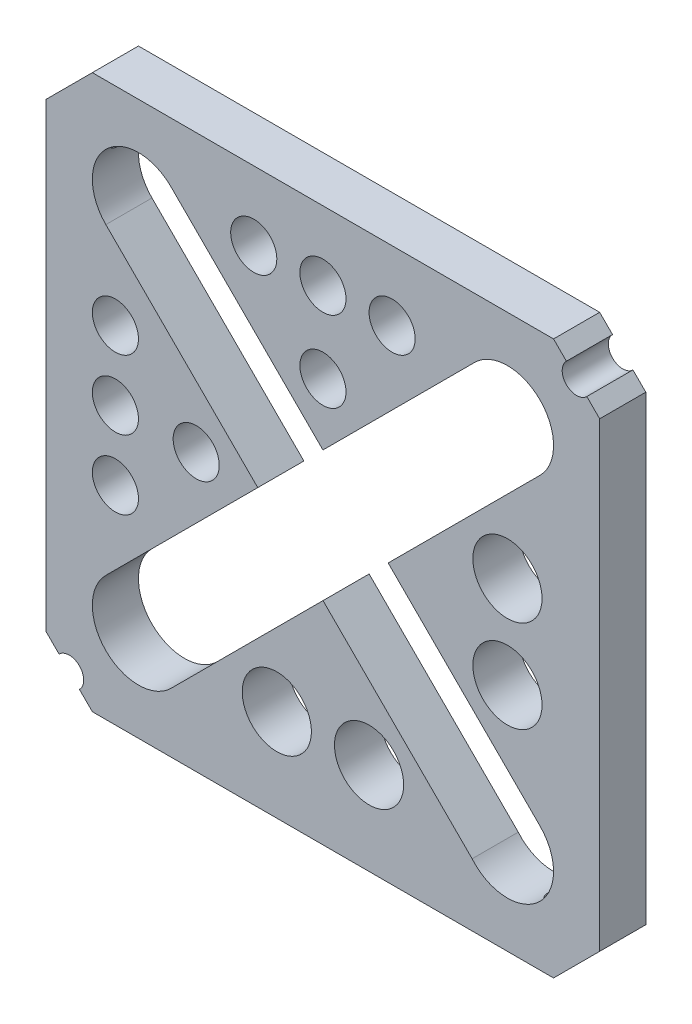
ISO-10303-21;
HEADER;
FILE_DESCRIPTION(('STEP AP214'),'2;1');
FILE_NAME('part.step','',(''),(''),'','','');
FILE_SCHEMA(('AUTOMOTIVE_DESIGN { 1 0 10303 214 1 1 1 1 }'));
ENDSEC;
DATA;
#1=APPLICATION_CONTEXT('core data for automotive mechanical design processes');
#2=APPLICATION_PROTOCOL_DEFINITION('international standard','automotive_design',2000,#1);
#3=PRODUCT_CONTEXT('',#1,'mechanical');
#4=PRODUCT('Part','Part','',(#3));
#5=PRODUCT_RELATED_PRODUCT_CATEGORY('part','',(#4));
#6=PRODUCT_DEFINITION_FORMATION('','',#4);
#7=PRODUCT_DEFINITION_CONTEXT('part definition',#1,'design');
#8=PRODUCT_DEFINITION('design','',#6,#7);
#9=PRODUCT_DEFINITION_SHAPE('','',#8);
#10=(LENGTH_UNIT() NAMED_UNIT(*) SI_UNIT(.MILLI.,.METRE.));
#11=(NAMED_UNIT(*) PLANE_ANGLE_UNIT() SI_UNIT($,.RADIAN.));
#12=(NAMED_UNIT(*) SI_UNIT($,.STERADIAN.) SOLID_ANGLE_UNIT());
#13=UNCERTAINTY_MEASURE_WITH_UNIT(LENGTH_MEASURE(1.E-05),#10,'distance_accuracy_value','');
#14=(GEOMETRIC_REPRESENTATION_CONTEXT(3) GLOBAL_UNCERTAINTY_ASSIGNED_CONTEXT((#13)) GLOBAL_UNIT_ASSIGNED_CONTEXT((#10,
#11,#12)) REPRESENTATION_CONTEXT('',''));
#15=CARTESIAN_POINT('',(0.,0.,0.));
#16=DIRECTION('',(0.,0.,1.));
#17=DIRECTION('',(1.,0.,0.));
#18=AXIS2_PLACEMENT_3D('',#15,#16,#17);
#19=CARTESIAN_POINT('',(34.925,34.925,6.35));
#20=DIRECTION('',(0.,0.,1.));
#21=DIRECTION('',(1.,0.,0.));
#22=AXIS2_PLACEMENT_3D('',#19,#20,#21);
#23=PLANE('',#22);
#24=CARTESIAN_POINT('',(0.,17.4752,6.35));
#25=DIRECTION('',(0.,0.,1.));
#26=DIRECTION('',(1.,0.,0.));
#27=AXIS2_PLACEMENT_3D('',#24,#25,#26);
#28=CIRCLE('',#27,3.175);
#29=CARTESIAN_POINT('',(3.175,17.4752,6.35));
#30=VERTEX_POINT('',#29);
#31=EDGE_CURVE('E1254',#30,#30,#28,.T.);
#32=ORIENTED_EDGE('',*,*,#31,.F.);
#33=EDGE_LOOP('',(#32));
#34=FACE_BOUND('',#33,.T.);
#35=CARTESIAN_POINT('',(9.52499999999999,28.575,6.35));
#36=DIRECTION('',(0.,0.,1.));
#37=DIRECTION('',(1.,0.,0.));
#38=AXIS2_PLACEMENT_3D('',#35,#36,#37);
#39=CIRCLE('',#38,3.175);
#40=CARTESIAN_POINT('',(12.7,28.575,6.35));
#41=VERTEX_POINT('',#40);
#42=EDGE_CURVE('E1249',#41,#41,#39,.T.);
#43=ORIENTED_EDGE('',*,*,#42,.F.);
#44=EDGE_LOOP('',(#43));
#45=FACE_BOUND('',#44,.T.);
#46=CARTESIAN_POINT('',(0.,28.575,6.35));
#47=DIRECTION('',(0.,0.,1.));
#48=DIRECTION('',(1.,0.,0.));
#49=AXIS2_PLACEMENT_3D('',#46,#47,#48);
#50=CIRCLE('',#49,3.175);
#51=CARTESIAN_POINT('',(3.17499999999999,28.575,6.35));
#52=VERTEX_POINT('',#51);
#53=EDGE_CURVE('E1244',#52,#52,#50,.T.);
#54=ORIENTED_EDGE('',*,*,#53,.F.);
#55=EDGE_LOOP('',(#54));
#56=FACE_BOUND('',#55,.T.);
#57=CARTESIAN_POINT('',(-9.52500000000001,28.575,6.35));
#58=DIRECTION('',(0.,0.,1.));
#59=DIRECTION('',(1.,0.,0.));
#60=AXIS2_PLACEMENT_3D('',#57,#58,#59);
#61=CIRCLE('',#60,3.175);
#62=CARTESIAN_POINT('',(-6.35000000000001,28.575,6.35));
#63=VERTEX_POINT('',#62);
#64=EDGE_CURVE('E1239',#63,#63,#61,.T.);
#65=ORIENTED_EDGE('',*,*,#64,.F.);
#66=EDGE_LOOP('',(#65));
#67=FACE_BOUND('',#66,.T.);
#68=CARTESIAN_POINT('',(-28.575,-9.52500000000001,6.35));
#69=DIRECTION('',(0.,0.,1.));
#70=DIRECTION('',(1.,0.,0.));
#71=AXIS2_PLACEMENT_3D('',#68,#69,#70);
#72=CIRCLE('',#71,3.175);
#73=CARTESIAN_POINT('',(-25.4,-9.52500000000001,6.35));
#74=VERTEX_POINT('',#73);
#75=EDGE_CURVE('E1234',#74,#74,#72,.T.);
#76=ORIENTED_EDGE('',*,*,#75,.F.);
#77=EDGE_LOOP('',(#76));
#78=FACE_BOUND('',#77,.T.);
#79=CARTESIAN_POINT('',(-17.4498,0.,6.35));
#80=DIRECTION('',(0.,0.,1.));
#81=DIRECTION('',(1.,0.,0.));
#82=AXIS2_PLACEMENT_3D('',#79,#80,#81);
#83=CIRCLE('',#82,3.175);
#84=CARTESIAN_POINT('',(-14.2748,0.,6.35));
#85=VERTEX_POINT('',#84);
#86=EDGE_CURVE('E1229',#85,#85,#83,.T.);
#87=ORIENTED_EDGE('',*,*,#86,.F.);
#88=EDGE_LOOP('',(#87));
#89=FACE_BOUND('',#88,.T.);
#90=CARTESIAN_POINT('',(-28.575,9.525,6.35));
#91=DIRECTION('',(0.,0.,1.));
#92=DIRECTION('',(1.,0.,0.));
#93=AXIS2_PLACEMENT_3D('',#90,#91,#92);
#94=CIRCLE('',#93,3.175);
#95=CARTESIAN_POINT('',(-25.4,9.525,6.35));
#96=VERTEX_POINT('',#95);
#97=EDGE_CURVE('E1224',#96,#96,#94,.T.);
#98=ORIENTED_EDGE('',*,*,#97,.F.);
#99=EDGE_LOOP('',(#98));
#100=FACE_BOUND('',#99,.T.);
#101=CARTESIAN_POINT('',(-28.575,0.,6.35));
#102=DIRECTION('',(0.,0.,1.));
#103=DIRECTION('',(1.,0.,0.));
#104=AXIS2_PLACEMENT_3D('',#101,#102,#103);
#105=CIRCLE('',#104,3.175);
#106=CARTESIAN_POINT('',(-25.4,0.,6.35));
#107=VERTEX_POINT('',#106);
#108=EDGE_CURVE('E1219',#107,#107,#105,.T.);
#109=ORIENTED_EDGE('',*,*,#108,.F.);
#110=EDGE_LOOP('',(#109));
#111=FACE_BOUND('',#110,.T.);
#112=CARTESIAN_POINT('',(-6.35000000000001,-25.4,6.35));
#113=DIRECTION('',(0.,0.,1.));
#114=DIRECTION('',(1.,0.,0.));
#115=AXIS2_PLACEMENT_3D('',#112,#113,#114);
#116=CIRCLE('',#115,4.7625);
#117=CARTESIAN_POINT('',(-1.58750000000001,-25.4,6.35));
#118=VERTEX_POINT('',#117);
#119=EDGE_CURVE('E1214',#118,#118,#116,.T.);
#120=ORIENTED_EDGE('',*,*,#119,.F.);
#121=EDGE_LOOP('',(#120));
#122=FACE_BOUND('',#121,.T.);
#123=CARTESIAN_POINT('',(6.34999999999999,-25.4,6.35));
#124=DIRECTION('',(0.,0.,1.));
#125=DIRECTION('',(1.,0.,0.));
#126=AXIS2_PLACEMENT_3D('',#123,#124,#125);
#127=CIRCLE('',#126,4.7625);
#128=CARTESIAN_POINT('',(11.1125,-25.4,6.35));
#129=VERTEX_POINT('',#128);
#130=EDGE_CURVE('E1209',#129,#129,#127,.T.);
#131=ORIENTED_EDGE('',*,*,#130,.F.);
#132=EDGE_LOOP('',(#131));
#133=FACE_BOUND('',#132,.T.);
#134=CARTESIAN_POINT('',(25.4,-6.35,6.35));
#135=DIRECTION('',(0.,0.,1.));
#136=DIRECTION('',(1.,0.,0.));
#137=AXIS2_PLACEMENT_3D('',#134,#135,#136);
#138=CIRCLE('',#137,4.7625);
#139=CARTESIAN_POINT('',(30.1625,-6.35,6.35));
#140=VERTEX_POINT('',#139);
#141=EDGE_CURVE('E1204',#140,#140,#138,.T.);
#142=ORIENTED_EDGE('',*,*,#141,.F.);
#143=EDGE_LOOP('',(#142));
#144=FACE_BOUND('',#143,.T.);
#145=CARTESIAN_POINT('',(25.4,6.34999999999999,6.35));
#146=DIRECTION('',(0.,0.,1.));
#147=DIRECTION('',(1.,0.,0.));
#148=AXIS2_PLACEMENT_3D('',#145,#146,#147);
#149=CIRCLE('',#148,4.7625);
#150=CARTESIAN_POINT('',(30.1625,6.34999999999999,6.35));
#151=VERTEX_POINT('',#150);
#152=EDGE_CURVE('E1199',#151,#151,#149,.T.);
#153=ORIENTED_EDGE('',*,*,#152,.F.);
#154=EDGE_LOOP('',(#153));
#155=FACE_BOUND('',#154,.T.);
#156=DIRECTION('',(0.,-1.,0.));
#157=VECTOR('',#156,1.);
#158=CARTESIAN_POINT('',(-38.1,-31.75,6.35));
#159=LINE('',#158,#157);
#160=CARTESIAN_POINT('',(-38.1,31.75,6.35));
#161=VERTEX_POINT('',#160);
#162=CARTESIAN_POINT('',(-38.1,-31.75,6.35));
#163=VERTEX_POINT('',#162);
#164=EDGE_CURVE('E1259',#161,#163,#159,.T.);
#165=ORIENTED_EDGE('',*,*,#164,.T.);
#166=DIRECTION('',(0.707106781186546,-0.707106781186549,0.));
#167=VECTOR('',#166,1.);
#168=CARTESIAN_POINT('',(-38.1,-31.75,6.35));
#169=LINE('',#168,#167);
#170=CARTESIAN_POINT('',(-36.3281650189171,-33.521834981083,6.35));
#171=VERTEX_POINT('',#170);
#172=EDGE_CURVE('E1263',#163,#171,#169,.T.);
#173=ORIENTED_EDGE('',*,*,#172,.T.);
#174=CARTESIAN_POINT('',(-34.925,-34.925,6.35));
#175=DIRECTION('',(0.,0.,-1.));
#176=DIRECTION('',(1.,0.,0.));
#177=AXIS2_PLACEMENT_3D('',#174,#175,#176);
#178=CIRCLE('',#177,1.984375);
#179=CARTESIAN_POINT('',(-33.521834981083,-36.3281650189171,6.35));
#180=VERTEX_POINT('',#179);
#181=EDGE_CURVE('E1267',#171,#180,#178,.T.);
#182=ORIENTED_EDGE('',*,*,#181,.T.);
#183=DIRECTION('',(0.707106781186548,-0.707106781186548,0.));
#184=VECTOR('',#183,1.);
#185=CARTESIAN_POINT('',(-33.521834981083,-36.3281650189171,6.35));
#186=LINE('',#185,#184);
#187=CARTESIAN_POINT('',(-31.75,-38.1,6.35));
#188=VERTEX_POINT('',#187);
#189=EDGE_CURVE('E1270',#180,#188,#186,.T.);
#190=ORIENTED_EDGE('',*,*,#189,.T.);
#191=DIRECTION('',(1.,0.,0.));
#192=VECTOR('',#191,1.);
#193=CARTESIAN_POINT('',(-31.75,-38.1,6.35));
#194=LINE('',#193,#192);
#195=CARTESIAN_POINT('',(31.75,-38.1,6.35));
#196=VERTEX_POINT('',#195);
#197=EDGE_CURVE('E1273',#188,#196,#194,.T.);
#198=ORIENTED_EDGE('',*,*,#197,.T.);
#199=DIRECTION('',(0.707106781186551,0.707106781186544,0.));
#200=VECTOR('',#199,1.);
#201=CARTESIAN_POINT('',(31.75,-38.1,6.35));
#202=LINE('',#201,#200);
#203=CARTESIAN_POINT('',(38.1,-31.75,6.35));
#204=VERTEX_POINT('',#203);
#205=EDGE_CURVE('E1276',#196,#204,#202,.T.);
#206=ORIENTED_EDGE('',*,*,#205,.T.);
#207=DIRECTION('',(0.,1.,0.));
#208=VECTOR('',#207,1.);
#209=CARTESIAN_POINT('',(38.1,-31.75,6.35));
#210=LINE('',#209,#208);
#211=CARTESIAN_POINT('',(38.1,31.7499999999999,6.35));
#212=VERTEX_POINT('',#211);
#213=EDGE_CURVE('E1279',#204,#212,#210,.T.);
#214=ORIENTED_EDGE('',*,*,#213,.T.);
#215=DIRECTION('',(-0.707106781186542,0.707106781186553,0.));
#216=VECTOR('',#215,1.);
#217=CARTESIAN_POINT('',(36.328165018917,33.5218349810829,6.35));
#218=LINE('',#217,#216);
#219=CARTESIAN_POINT('',(36.328165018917,33.5218349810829,6.35));
#220=VERTEX_POINT('',#219);
#221=EDGE_CURVE('E1282',#212,#220,#218,.T.);
#222=ORIENTED_EDGE('',*,*,#221,.T.);
#223=CARTESIAN_POINT('',(34.925,34.925,6.35));
#224=DIRECTION('',(0.,0.,-1.));
#225=DIRECTION('',(1.,0.,0.));
#226=AXIS2_PLACEMENT_3D('',#223,#224,#225);
#227=CIRCLE('',#226,1.984375);
#228=CARTESIAN_POINT('',(33.5218349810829,36.328165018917,6.35));
#229=VERTEX_POINT('',#228);
#230=EDGE_CURVE('E1285',#220,#229,#227,.T.);
#231=ORIENTED_EDGE('',*,*,#230,.T.);
#232=DIRECTION('',(-0.707106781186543,0.707106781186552,0.));
#233=VECTOR('',#232,1.);
#234=CARTESIAN_POINT('',(31.75,38.1,6.35));
#235=LINE('',#234,#233);
#236=CARTESIAN_POINT('',(31.75,38.1,6.35));
#237=VERTEX_POINT('',#236);
#238=EDGE_CURVE('E1288',#229,#237,#235,.T.);
#239=ORIENTED_EDGE('',*,*,#238,.T.);
#240=DIRECTION('',(-1.,0.,0.));
#241=VECTOR('',#240,1.);
#242=CARTESIAN_POINT('',(-31.75,38.1,6.35));
#243=LINE('',#242,#241);
#244=CARTESIAN_POINT('',(-31.75,38.1,6.35));
#245=VERTEX_POINT('',#244);
#246=EDGE_CURVE('E1291',#237,#245,#243,.T.);
#247=ORIENTED_EDGE('',*,*,#246,.T.);
#248=DIRECTION('',(-0.707106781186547,-0.707106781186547,0.));
#249=VECTOR('',#248,1.);
#250=CARTESIAN_POINT('',(-38.1,31.75,6.35));
#251=LINE('',#250,#249);
#252=EDGE_CURVE('E1294',#245,#161,#251,.T.);
#253=ORIENTED_EDGE('',*,*,#252,.T.);
#254=EDGE_LOOP('',(#165,#173,#182,#190,#198,#206,#214,#222,#231,#239,#247,#253));
#255=FACE_BOUND('',#254,.T.);
#256=CARTESIAN_POINT('',(-25.4,-25.4,6.35));
#257=DIRECTION('',(0.,0.,1.));
#258=DIRECTION('',(1.,0.,0.));
#259=AXIS2_PLACEMENT_3D('',#256,#257,#258);
#260=CIRCLE('',#259,6.35);
#261=CARTESIAN_POINT('',(-29.8901280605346,-20.9098719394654,6.35));
#262=VERTEX_POINT('',#261);
#263=CARTESIAN_POINT('',(-20.9098719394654,-29.8901280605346,6.35));
#264=VERTEX_POINT('',#263);
#265=EDGE_CURVE('E1140',#262,#264,#260,.T.);
#266=ORIENTED_EDGE('',*,*,#265,.F.);
#267=DIRECTION('',(0.707106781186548,0.707106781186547,0.));
#268=VECTOR('',#267,1.);
#269=CARTESIAN_POINT('',(30.4348719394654,39.4151280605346,6.35));
#270=LINE('',#269,#268);
#271=CARTESIAN_POINT('',(-8.97332141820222,0.00693470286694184,6.35));
#272=VERTEX_POINT('',#271);
#273=EDGE_CURVE('E1195',#262,#272,#270,.T.);
#274=ORIENTED_EDGE('',*,*,#273,.T.);
#275=DIRECTION('',(-0.707341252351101,0.706872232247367,0.));
#276=VECTOR('',#275,1.);
#277=CARTESIAN_POINT('',(-4.46863075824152,-4.49476901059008,6.35));
#278=LINE('',#277,#276);
#279=CARTESIAN_POINT('',(-29.8901280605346,20.9098719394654,6.35));
#280=VERTEX_POINT('',#279);
#281=EDGE_CURVE('E1191',#272,#280,#278,.T.);
#282=ORIENTED_EDGE('',*,*,#281,.T.);
#283=CARTESIAN_POINT('',(-25.4,25.4,6.35));
#284=DIRECTION('',(0.,0.,1.));
#285=DIRECTION('',(1.,0.,0.));
#286=AXIS2_PLACEMENT_3D('',#283,#284,#285);
#287=CIRCLE('',#286,6.35000000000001);
#288=CARTESIAN_POINT('',(-20.9098719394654,29.8901280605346,6.35));
#289=VERTEX_POINT('',#288);
#290=EDGE_CURVE('E1188',#289,#280,#287,.T.);
#291=ORIENTED_EDGE('',*,*,#290,.F.);
#292=DIRECTION('',(-0.707106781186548,0.707106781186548,0.));
#293=VECTOR('',#292,1.);
#294=CARTESIAN_POINT('',(4.49012806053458,4.49012806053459,6.35));
#295=LINE('',#294,#293);
#296=CARTESIAN_POINT('',(0.,8.98025612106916,6.35));
#297=VERTEX_POINT('',#296);
#298=EDGE_CURVE('E1185',#297,#289,#295,.T.);
#299=ORIENTED_EDGE('',*,*,#298,.F.);
#300=DIRECTION('',(0.707106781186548,0.707106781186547,0.));
#301=VECTOR('',#300,1.);
#302=CARTESIAN_POINT('',(30.4348719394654,39.4151280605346,6.35));
#303=LINE('',#302,#301);
#304=CARTESIAN_POINT('',(20.9098719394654,29.8901280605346,6.35));
#305=VERTEX_POINT('',#304);
#306=EDGE_CURVE('E1181',#297,#305,#303,.T.);
#307=ORIENTED_EDGE('',*,*,#306,.T.);
#308=CARTESIAN_POINT('',(25.4,25.4,6.35));
#309=DIRECTION('',(0.,0.,1.));
#310=DIRECTION('',(1.,0.,0.));
#311=AXIS2_PLACEMENT_3D('',#308,#309,#310);
#312=CIRCLE('',#311,6.34999999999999);
#313=CARTESIAN_POINT('',(29.8901280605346,20.9098719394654,6.35));
#314=VERTEX_POINT('',#313);
#315=EDGE_CURVE('E1178',#314,#305,#312,.T.);
#316=ORIENTED_EDGE('',*,*,#315,.F.);
#317=DIRECTION('',(-0.707106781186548,-0.707106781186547,0.));
#318=VECTOR('',#317,1.);
#319=CARTESIAN_POINT('',(39.4151280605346,30.4348719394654,6.35));
#320=LINE('',#319,#318);
#321=CARTESIAN_POINT('',(8.98025612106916,0.,6.35));
#322=VERTEX_POINT('',#321);
#323=EDGE_CURVE('E1174',#314,#322,#320,.T.);
#324=ORIENTED_EDGE('',*,*,#323,.T.);
#325=DIRECTION('',(-0.707106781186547,0.707106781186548,0.));
#326=VECTOR('',#325,1.);
#327=CARTESIAN_POINT('',(4.49012806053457,4.4901280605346,6.35));
#328=LINE('',#327,#326);
#329=CARTESIAN_POINT('',(29.8901280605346,-20.9098719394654,6.35));
#330=VERTEX_POINT('',#329);
#331=EDGE_CURVE('E1171',#330,#322,#328,.T.);
#332=ORIENTED_EDGE('',*,*,#331,.F.);
#333=CARTESIAN_POINT('',(25.4,-25.4,6.35));
#334=DIRECTION('',(0.,0.,1.));
#335=DIRECTION('',(1.,0.,0.));
#336=AXIS2_PLACEMENT_3D('',#333,#334,#335);
#337=CIRCLE('',#336,6.35);
#338=CARTESIAN_POINT('',(20.5394684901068,-29.4862860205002,6.35));
#339=VERTEX_POINT('',#338);
#340=EDGE_CURVE('E1165',#339,#330,#337,.T.);
#341=ORIENTED_EDGE('',*,*,#340,.F.);
#342=DIRECTION('',(-0.707341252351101,0.706872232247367,0.));
#343=VECTOR('',#342,1.);
#344=CARTESIAN_POINT('',(-4.46863075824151,-4.49476901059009,6.35));
#345=LINE('',#344,#343);
#346=CARTESIAN_POINT('',(0.00991298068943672,-8.97034314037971,6.35));
#347=VERTEX_POINT('',#346);
#348=EDGE_CURVE('E1161',#339,#347,#345,.T.);
#349=ORIENTED_EDGE('',*,*,#348,.T.);
#350=DIRECTION('',(-0.707106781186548,-0.707106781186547,0.));
#351=VECTOR('',#350,1.);
#352=CARTESIAN_POINT('',(39.4151280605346,30.4348719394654,6.35));
#353=LINE('',#352,#351);
#354=EDGE_CURVE('E1146',#347,#264,#353,.T.);
#355=ORIENTED_EDGE('',*,*,#354,.T.);
#356=EDGE_LOOP('',(#266,#274,#282,#291,#299,#307,#316,#324,#332,#341,#349,#355));
#357=FACE_BOUND('',#356,.T.);
#358=ADVANCED_FACE('F975',(#34,#45,#56,#67,#78,#89,#100,#111,#122,#133,#144,#155,#255,#357),#23,.T.);
#359=CARTESIAN_POINT('',(34.925,34.925,0.));
#360=DIRECTION('',(0.,0.,1.));
#361=DIRECTION('',(1.,0.,0.));
#362=AXIS2_PLACEMENT_3D('',#359,#360,#361);
#363=PLANE('',#362);
#364=CARTESIAN_POINT('',(0.,17.4752,0.));
#365=DIRECTION('',(0.,0.,1.));
#366=DIRECTION('',(1.,0.,0.));
#367=AXIS2_PLACEMENT_3D('',#364,#365,#366);
#368=CIRCLE('',#367,3.175);
#369=CARTESIAN_POINT('',(3.175,17.4752,0.));
#370=VERTEX_POINT('',#369);
#371=EDGE_CURVE('E1253',#370,#370,#368,.T.);
#372=ORIENTED_EDGE('',*,*,#371,.T.);
#373=EDGE_LOOP('',(#372));
#374=FACE_BOUND('',#373,.T.);
#375=CARTESIAN_POINT('',(9.52499999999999,28.575,0.));
#376=DIRECTION('',(0.,0.,1.));
#377=DIRECTION('',(1.,0.,0.));
#378=AXIS2_PLACEMENT_3D('',#375,#376,#377);
#379=CIRCLE('',#378,3.175);
#380=CARTESIAN_POINT('',(12.7,28.575,0.));
#381=VERTEX_POINT('',#380);
#382=EDGE_CURVE('E1248',#381,#381,#379,.T.);
#383=ORIENTED_EDGE('',*,*,#382,.T.);
#384=EDGE_LOOP('',(#383));
#385=FACE_BOUND('',#384,.T.);
#386=CARTESIAN_POINT('',(0.,28.575,0.));
#387=DIRECTION('',(0.,0.,1.));
#388=DIRECTION('',(1.,0.,0.));
#389=AXIS2_PLACEMENT_3D('',#386,#387,#388);
#390=CIRCLE('',#389,3.175);
#391=CARTESIAN_POINT('',(3.17499999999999,28.575,0.));
#392=VERTEX_POINT('',#391);
#393=EDGE_CURVE('E1243',#392,#392,#390,.T.);
#394=ORIENTED_EDGE('',*,*,#393,.T.);
#395=EDGE_LOOP('',(#394));
#396=FACE_BOUND('',#395,.T.);
#397=CARTESIAN_POINT('',(-9.52500000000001,28.575,0.));
#398=DIRECTION('',(0.,0.,1.));
#399=DIRECTION('',(1.,0.,0.));
#400=AXIS2_PLACEMENT_3D('',#397,#398,#399);
#401=CIRCLE('',#400,3.175);
#402=CARTESIAN_POINT('',(-6.35000000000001,28.575,0.));
#403=VERTEX_POINT('',#402);
#404=EDGE_CURVE('E1238',#403,#403,#401,.T.);
#405=ORIENTED_EDGE('',*,*,#404,.T.);
#406=EDGE_LOOP('',(#405));
#407=FACE_BOUND('',#406,.T.);
#408=CARTESIAN_POINT('',(-28.575,-9.52500000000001,0.));
#409=DIRECTION('',(0.,0.,1.));
#410=DIRECTION('',(1.,0.,0.));
#411=AXIS2_PLACEMENT_3D('',#408,#409,#410);
#412=CIRCLE('',#411,3.175);
#413=CARTESIAN_POINT('',(-25.4,-9.52500000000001,0.));
#414=VERTEX_POINT('',#413);
#415=EDGE_CURVE('E1233',#414,#414,#412,.T.);
#416=ORIENTED_EDGE('',*,*,#415,.T.);
#417=EDGE_LOOP('',(#416));
#418=FACE_BOUND('',#417,.T.);
#419=CARTESIAN_POINT('',(-17.4498,0.,0.));
#420=DIRECTION('',(0.,0.,1.));
#421=DIRECTION('',(1.,0.,0.));
#422=AXIS2_PLACEMENT_3D('',#419,#420,#421);
#423=CIRCLE('',#422,3.175);
#424=CARTESIAN_POINT('',(-14.2748,0.,0.));
#425=VERTEX_POINT('',#424);
#426=EDGE_CURVE('E1228',#425,#425,#423,.T.);
#427=ORIENTED_EDGE('',*,*,#426,.T.);
#428=EDGE_LOOP('',(#427));
#429=FACE_BOUND('',#428,.T.);
#430=CARTESIAN_POINT('',(-28.575,9.525,0.));
#431=DIRECTION('',(0.,0.,1.));
#432=DIRECTION('',(1.,0.,0.));
#433=AXIS2_PLACEMENT_3D('',#430,#431,#432);
#434=CIRCLE('',#433,3.175);
#435=CARTESIAN_POINT('',(-25.4,9.525,0.));
#436=VERTEX_POINT('',#435);
#437=EDGE_CURVE('E1223',#436,#436,#434,.T.);
#438=ORIENTED_EDGE('',*,*,#437,.T.);
#439=EDGE_LOOP('',(#438));
#440=FACE_BOUND('',#439,.T.);
#441=CARTESIAN_POINT('',(-28.575,0.,0.));
#442=DIRECTION('',(0.,0.,1.));
#443=DIRECTION('',(1.,0.,0.));
#444=AXIS2_PLACEMENT_3D('',#441,#442,#443);
#445=CIRCLE('',#444,3.175);
#446=CARTESIAN_POINT('',(-25.4,0.,0.));
#447=VERTEX_POINT('',#446);
#448=EDGE_CURVE('E1218',#447,#447,#445,.T.);
#449=ORIENTED_EDGE('',*,*,#448,.T.);
#450=EDGE_LOOP('',(#449));
#451=FACE_BOUND('',#450,.T.);
#452=CARTESIAN_POINT('',(-6.35000000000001,-25.4,0.));
#453=DIRECTION('',(0.,0.,1.));
#454=DIRECTION('',(1.,0.,0.));
#455=AXIS2_PLACEMENT_3D('',#452,#453,#454);
#456=CIRCLE('',#455,4.7625);
#457=CARTESIAN_POINT('',(-1.58750000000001,-25.4,0.));
#458=VERTEX_POINT('',#457);
#459=EDGE_CURVE('E1213',#458,#458,#456,.T.);
#460=ORIENTED_EDGE('',*,*,#459,.T.);
#461=EDGE_LOOP('',(#460));
#462=FACE_BOUND('',#461,.T.);
#463=CARTESIAN_POINT('',(6.34999999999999,-25.4,0.));
#464=DIRECTION('',(0.,0.,1.));
#465=DIRECTION('',(1.,0.,0.));
#466=AXIS2_PLACEMENT_3D('',#463,#464,#465);
#467=CIRCLE('',#466,4.7625);
#468=CARTESIAN_POINT('',(11.1125,-25.4,0.));
#469=VERTEX_POINT('',#468);
#470=EDGE_CURVE('E1208',#469,#469,#467,.T.);
#471=ORIENTED_EDGE('',*,*,#470,.T.);
#472=EDGE_LOOP('',(#471));
#473=FACE_BOUND('',#472,.T.);
#474=CARTESIAN_POINT('',(25.4,-6.35,0.));
#475=DIRECTION('',(0.,0.,1.));
#476=DIRECTION('',(1.,0.,0.));
#477=AXIS2_PLACEMENT_3D('',#474,#475,#476);
#478=CIRCLE('',#477,4.7625);
#479=CARTESIAN_POINT('',(30.1625,-6.35,0.));
#480=VERTEX_POINT('',#479);
#481=EDGE_CURVE('E1203',#480,#480,#478,.T.);
#482=ORIENTED_EDGE('',*,*,#481,.T.);
#483=EDGE_LOOP('',(#482));
#484=FACE_BOUND('',#483,.T.);
#485=CARTESIAN_POINT('',(25.4,6.34999999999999,0.));
#486=DIRECTION('',(0.,0.,1.));
#487=DIRECTION('',(1.,0.,0.));
#488=AXIS2_PLACEMENT_3D('',#485,#486,#487);
#489=CIRCLE('',#488,4.7625);
#490=CARTESIAN_POINT('',(30.1625,6.34999999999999,0.));
#491=VERTEX_POINT('',#490);
#492=EDGE_CURVE('E1198',#491,#491,#489,.T.);
#493=ORIENTED_EDGE('',*,*,#492,.T.);
#494=EDGE_LOOP('',(#493));
#495=FACE_BOUND('',#494,.T.);
#496=DIRECTION('',(0.,-1.,0.));
#497=VECTOR('',#496,1.);
#498=CARTESIAN_POINT('',(-38.1,-31.75,0.));
#499=LINE('',#498,#497);
#500=CARTESIAN_POINT('',(-38.1,31.75,0.));
#501=VERTEX_POINT('',#500);
#502=CARTESIAN_POINT('',(-38.1,-31.75,0.));
#503=VERTEX_POINT('',#502);
#504=EDGE_CURVE('E1258',#501,#503,#499,.T.);
#505=ORIENTED_EDGE('',*,*,#504,.F.);
#506=DIRECTION('',(-0.707106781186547,-0.707106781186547,0.));
#507=VECTOR('',#506,1.);
#508=CARTESIAN_POINT('',(-38.1,31.75,0.));
#509=LINE('',#508,#507);
#510=CARTESIAN_POINT('',(-31.75,38.1,0.));
#511=VERTEX_POINT('',#510);
#512=EDGE_CURVE('E1264',#511,#501,#509,.T.);
#513=ORIENTED_EDGE('',*,*,#512,.F.);
#514=DIRECTION('',(-1.,0.,0.));
#515=VECTOR('',#514,1.);
#516=CARTESIAN_POINT('',(-31.75,38.1,0.));
#517=LINE('',#516,#515);
#518=CARTESIAN_POINT('',(31.75,38.1,0.));
#519=VERTEX_POINT('',#518);
#520=EDGE_CURVE('E1328',#519,#511,#517,.T.);
#521=ORIENTED_EDGE('',*,*,#520,.F.);
#522=DIRECTION('',(-0.707106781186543,0.707106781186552,0.));
#523=VECTOR('',#522,1.);
#524=CARTESIAN_POINT('',(31.75,38.1,0.));
#525=LINE('',#524,#523);
#526=CARTESIAN_POINT('',(33.5218349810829,36.328165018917,0.));
#527=VERTEX_POINT('',#526);
#528=EDGE_CURVE('E1325',#527,#519,#525,.T.);
#529=ORIENTED_EDGE('',*,*,#528,.F.);
#530=CARTESIAN_POINT('',(34.925,34.925,0.));
#531=DIRECTION('',(0.,0.,-1.));
#532=DIRECTION('',(1.,0.,0.));
#533=AXIS2_PLACEMENT_3D('',#530,#531,#532);
#534=CIRCLE('',#533,1.984375);
#535=CARTESIAN_POINT('',(36.328165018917,33.5218349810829,0.));
#536=VERTEX_POINT('',#535);
#537=EDGE_CURVE('E1322',#536,#527,#534,.T.);
#538=ORIENTED_EDGE('',*,*,#537,.F.);
#539=DIRECTION('',(-0.707106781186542,0.707106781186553,0.));
#540=VECTOR('',#539,1.);
#541=CARTESIAN_POINT('',(36.328165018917,33.5218349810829,0.));
#542=LINE('',#541,#540);
#543=CARTESIAN_POINT('',(38.1,31.7499999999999,0.));
#544=VERTEX_POINT('',#543);
#545=EDGE_CURVE('E1319',#544,#536,#542,.T.);
#546=ORIENTED_EDGE('',*,*,#545,.F.);
#547=DIRECTION('',(0.,1.,0.));
#548=VECTOR('',#547,1.);
#549=CARTESIAN_POINT('',(38.1,-31.75,0.));
#550=LINE('',#549,#548);
#551=CARTESIAN_POINT('',(38.1,-31.75,0.));
#552=VERTEX_POINT('',#551);
#553=EDGE_CURVE('E1316',#552,#544,#550,.T.);
#554=ORIENTED_EDGE('',*,*,#553,.F.);
#555=DIRECTION('',(0.707106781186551,0.707106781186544,0.));
#556=VECTOR('',#555,1.);
#557=CARTESIAN_POINT('',(31.75,-38.1,0.));
#558=LINE('',#557,#556);
#559=CARTESIAN_POINT('',(31.75,-38.1,0.));
#560=VERTEX_POINT('',#559);
#561=EDGE_CURVE('E1313',#560,#552,#558,.T.);
#562=ORIENTED_EDGE('',*,*,#561,.F.);
#563=DIRECTION('',(1.,0.,0.));
#564=VECTOR('',#563,1.);
#565=CARTESIAN_POINT('',(-31.75,-38.1,0.));
#566=LINE('',#565,#564);
#567=CARTESIAN_POINT('',(-31.75,-38.1,0.));
#568=VERTEX_POINT('',#567);
#569=EDGE_CURVE('E1310',#568,#560,#566,.T.);
#570=ORIENTED_EDGE('',*,*,#569,.F.);
#571=DIRECTION('',(0.707106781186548,-0.707106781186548,0.));
#572=VECTOR('',#571,1.);
#573=CARTESIAN_POINT('',(-33.521834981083,-36.3281650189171,0.));
#574=LINE('',#573,#572);
#575=CARTESIAN_POINT('',(-33.521834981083,-36.3281650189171,0.));
#576=VERTEX_POINT('',#575);
#577=EDGE_CURVE('E1307',#576,#568,#574,.T.);
#578=ORIENTED_EDGE('',*,*,#577,.F.);
#579=CARTESIAN_POINT('',(-34.925,-34.925,0.));
#580=DIRECTION('',(0.,0.,-1.));
#581=DIRECTION('',(1.,0.,0.));
#582=AXIS2_PLACEMENT_3D('',#579,#580,#581);
#583=CIRCLE('',#582,1.984375);
#584=CARTESIAN_POINT('',(-36.3281650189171,-33.521834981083,0.));
#585=VERTEX_POINT('',#584);
#586=EDGE_CURVE('E1304',#585,#576,#583,.T.);
#587=ORIENTED_EDGE('',*,*,#586,.F.);
#588=DIRECTION('',(0.707106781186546,-0.707106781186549,0.));
#589=VECTOR('',#588,1.);
#590=CARTESIAN_POINT('',(-38.1,-31.75,0.));
#591=LINE('',#590,#589);
#592=EDGE_CURVE('E1301',#503,#585,#591,.T.);
#593=ORIENTED_EDGE('',*,*,#592,.F.);
#594=EDGE_LOOP('',(#505,#513,#521,#529,#538,#546,#554,#562,#570,#578,#587,#593));
#595=FACE_BOUND('',#594,.T.);
#596=DIRECTION('',(0.707106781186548,0.707106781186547,0.));
#597=VECTOR('',#596,1.);
#598=CARTESIAN_POINT('',(30.4348719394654,39.4151280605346,0.));
#599=LINE('',#598,#597);
#600=CARTESIAN_POINT('',(-29.8901280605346,-20.9098719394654,0.));
#601=VERTEX_POINT('',#600);
#602=CARTESIAN_POINT('',(-8.97332141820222,0.00693470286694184,0.));
#603=VERTEX_POINT('',#602);
#604=EDGE_CURVE('E12',#601,#603,#599,.T.);
#605=ORIENTED_EDGE('',*,*,#604,.F.);
#606=CARTESIAN_POINT('',(-25.4,-25.4,0.));
#607=DIRECTION('',(0.,0.,1.));
#608=DIRECTION('',(1.,0.,0.));
#609=AXIS2_PLACEMENT_3D('',#606,#607,#608);
#610=CIRCLE('',#609,6.35);
#611=CARTESIAN_POINT('',(-20.9098719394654,-29.8901280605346,0.));
#612=VERTEX_POINT('',#611);
#613=EDGE_CURVE('E1380',#601,#612,#610,.T.);
#614=ORIENTED_EDGE('',*,*,#613,.T.);
#615=DIRECTION('',(-0.707106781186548,-0.707106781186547,0.));
#616=VECTOR('',#615,1.);
#617=CARTESIAN_POINT('',(39.4151280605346,30.4348719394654,0.));
#618=LINE('',#617,#616);
#619=CARTESIAN_POINT('',(0.00991298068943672,-8.97034314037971,0.));
#620=VERTEX_POINT('',#619);
#621=EDGE_CURVE('E1154',#620,#612,#618,.T.);
#622=ORIENTED_EDGE('',*,*,#621,.F.);
#623=DIRECTION('',(-0.707341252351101,0.706872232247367,0.));
#624=VECTOR('',#623,1.);
#625=CARTESIAN_POINT('',(-4.46863075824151,-4.49476901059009,0.));
#626=LINE('',#625,#624);
#627=CARTESIAN_POINT('',(20.5394684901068,-29.4862860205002,0.));
#628=VERTEX_POINT('',#627);
#629=EDGE_CURVE('E1385',#628,#620,#626,.T.);
#630=ORIENTED_EDGE('',*,*,#629,.F.);
#631=CARTESIAN_POINT('',(25.4,-25.4,0.));
#632=DIRECTION('',(0.,0.,1.));
#633=DIRECTION('',(1.,0.,0.));
#634=AXIS2_PLACEMENT_3D('',#631,#632,#633);
#635=CIRCLE('',#634,6.35);
#636=CARTESIAN_POINT('',(29.8901280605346,-20.9098719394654,0.));
#637=VERTEX_POINT('',#636);
#638=EDGE_CURVE('E1388',#628,#637,#635,.T.);
#639=ORIENTED_EDGE('',*,*,#638,.T.);
#640=DIRECTION('',(-0.707106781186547,0.707106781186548,0.));
#641=VECTOR('',#640,1.);
#642=CARTESIAN_POINT('',(4.49012806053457,4.4901280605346,0.));
#643=LINE('',#642,#641);
#644=CARTESIAN_POINT('',(8.98025612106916,0.,0.));
#645=VERTEX_POINT('',#644);
#646=EDGE_CURVE('E1392',#637,#645,#643,.T.);
#647=ORIENTED_EDGE('',*,*,#646,.T.);
#648=DIRECTION('',(-0.707106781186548,-0.707106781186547,0.));
#649=VECTOR('',#648,1.);
#650=CARTESIAN_POINT('',(39.4151280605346,30.4348719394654,0.));
#651=LINE('',#650,#649);
#652=CARTESIAN_POINT('',(29.8901280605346,20.9098719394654,0.));
#653=VERTEX_POINT('',#652);
#654=EDGE_CURVE('E1396',#653,#645,#651,.T.);
#655=ORIENTED_EDGE('',*,*,#654,.F.);
#656=CARTESIAN_POINT('',(25.4,25.4,0.));
#657=DIRECTION('',(0.,0.,1.));
#658=DIRECTION('',(1.,0.,0.));
#659=AXIS2_PLACEMENT_3D('',#656,#657,#658);
#660=CIRCLE('',#659,6.34999999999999);
#661=CARTESIAN_POINT('',(20.9098719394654,29.8901280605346,0.));
#662=VERTEX_POINT('',#661);
#663=EDGE_CURVE('E1399',#653,#662,#660,.T.);
#664=ORIENTED_EDGE('',*,*,#663,.T.);
#665=DIRECTION('',(0.707106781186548,0.707106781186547,0.));
#666=VECTOR('',#665,1.);
#667=CARTESIAN_POINT('',(30.4348719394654,39.4151280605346,0.));
#668=LINE('',#667,#666);
#669=CARTESIAN_POINT('',(0.,8.98025612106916,0.));
#670=VERTEX_POINT('',#669);
#671=EDGE_CURVE('E1403',#670,#662,#668,.T.);
#672=ORIENTED_EDGE('',*,*,#671,.F.);
#673=DIRECTION('',(-0.707106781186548,0.707106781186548,0.));
#674=VECTOR('',#673,1.);
#675=CARTESIAN_POINT('',(4.49012806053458,4.49012806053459,0.));
#676=LINE('',#675,#674);
#677=CARTESIAN_POINT('',(-20.9098719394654,29.8901280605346,0.));
#678=VERTEX_POINT('',#677);
#679=EDGE_CURVE('E1406',#670,#678,#676,.T.);
#680=ORIENTED_EDGE('',*,*,#679,.T.);
#681=CARTESIAN_POINT('',(-25.4,25.4,0.));
#682=DIRECTION('',(0.,0.,1.));
#683=DIRECTION('',(1.,0.,0.));
#684=AXIS2_PLACEMENT_3D('',#681,#682,#683);
#685=CIRCLE('',#684,6.35000000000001);
#686=CARTESIAN_POINT('',(-29.8901280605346,20.9098719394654,0.));
#687=VERTEX_POINT('',#686);
#688=EDGE_CURVE('E1410',#678,#687,#685,.T.);
#689=ORIENTED_EDGE('',*,*,#688,.T.);
#690=DIRECTION('',(-0.707341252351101,0.706872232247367,0.));
#691=VECTOR('',#690,1.);
#692=CARTESIAN_POINT('',(-4.46863075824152,-4.49476901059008,0.));
#693=LINE('',#692,#691);
#694=EDGE_CURVE('E990',#603,#687,#693,.T.);
#695=ORIENTED_EDGE('',*,*,#694,.F.);
#696=EDGE_LOOP('',(#605,#614,#622,#630,#639,#647,#655,#664,#672,#680,#689,#695));
#697=FACE_BOUND('',#696,.T.);
#698=ADVANCED_FACE('F1452',(#374,#385,#396,#407,#418,#429,#440,#451,#462,#473,#484,#495,#595,
#697),#363,.F.);
#699=CARTESIAN_POINT('',(-38.1,-31.75,6.35));
#700=DIRECTION('',(1.,0.,0.));
#701=DIRECTION('',(0.,0.,-1.));
#702=AXIS2_PLACEMENT_3D('',#699,#700,#701);
#703=PLANE('',#702);
#704=ORIENTED_EDGE('',*,*,#504,.T.);
#705=DIRECTION('',(0.,0.,-1.));
#706=VECTOR('',#705,1.);
#707=CARTESIAN_POINT('',(-38.1,-31.75,6.35));
#708=LINE('',#707,#706);
#709=EDGE_CURVE('E1376',#163,#503,#708,.T.);
#710=ORIENTED_EDGE('',*,*,#709,.F.);
#711=ORIENTED_EDGE('',*,*,#164,.F.);
#712=DIRECTION('',(0.,0.,-1.));
#713=VECTOR('',#712,1.);
#714=CARTESIAN_POINT('',(-38.1,31.75,6.35));
#715=LINE('',#714,#713);
#716=EDGE_CURVE('E1297',#161,#501,#715,.T.);
#717=ORIENTED_EDGE('',*,*,#716,.T.);
#718=EDGE_LOOP('',(#704,#710,#711,#717));
#719=FACE_BOUND('',#718,.T.);
#720=ADVANCED_FACE('F977',(#719),#703,.F.);
#721=CARTESIAN_POINT('',(-38.1,-31.75,6.35));
#722=DIRECTION('',(0.707106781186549,0.707106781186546,0.));
#723=DIRECTION('',(-0.707106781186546,0.707106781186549,0.));
#724=AXIS2_PLACEMENT_3D('',#721,#722,#723);
#725=PLANE('',#724);
#726=ORIENTED_EDGE('',*,*,#592,.T.);
#727=DIRECTION('',(0.,0.,-1.));
#728=VECTOR('',#727,1.);
#729=CARTESIAN_POINT('',(-36.3281650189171,-33.521834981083,6.35));
#730=LINE('',#729,#728);
#731=EDGE_CURVE('E1372',#171,#585,#730,.T.);
#732=ORIENTED_EDGE('',*,*,#731,.F.);
#733=ORIENTED_EDGE('',*,*,#172,.F.);
#734=ORIENTED_EDGE('',*,*,#709,.T.);
#735=EDGE_LOOP('',(#726,#732,#733,#734));
#736=FACE_BOUND('',#735,.T.);
#737=ADVANCED_FACE('F1522',(#736),#725,.F.);
#738=CARTESIAN_POINT('',(-34.925,-34.925,6.35));
#739=DIRECTION('',(0.,0.,-1.));
#740=DIRECTION('',(-1.,0.,0.));
#741=AXIS2_PLACEMENT_3D('',#738,#739,#740);
#742=CYLINDRICAL_SURFACE('',#741,1.984375);
#743=ORIENTED_EDGE('',*,*,#586,.T.);
#744=DIRECTION('',(0.,0.,-1.));
#745=VECTOR('',#744,1.);
#746=CARTESIAN_POINT('',(-33.521834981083,-36.3281650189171,6.35));
#747=LINE('',#746,#745);
#748=EDGE_CURVE('E1368',#180,#576,#747,.T.);
#749=ORIENTED_EDGE('',*,*,#748,.F.);
#750=ORIENTED_EDGE('',*,*,#181,.F.);
#751=ORIENTED_EDGE('',*,*,#731,.T.);
#752=EDGE_LOOP('',(#743,#749,#750,#751));
#753=FACE_BOUND('',#752,.T.);
#754=ADVANCED_FACE('F1519',(#753),#742,.F.);
#755=CARTESIAN_POINT('',(-33.521834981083,-36.3281650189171,6.35));
#756=DIRECTION('',(0.707106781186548,0.707106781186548,0.));
#757=DIRECTION('',(-0.707106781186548,0.707106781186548,0.));
#758=AXIS2_PLACEMENT_3D('',#755,#756,#757);
#759=PLANE('',#758);
#760=ORIENTED_EDGE('',*,*,#577,.T.);
#761=DIRECTION('',(0.,0.,-1.));
#762=VECTOR('',#761,1.);
#763=CARTESIAN_POINT('',(-31.75,-38.1,6.35));
#764=LINE('',#763,#762);
#765=EDGE_CURVE('E1364',#188,#568,#764,.T.);
#766=ORIENTED_EDGE('',*,*,#765,.F.);
#767=ORIENTED_EDGE('',*,*,#189,.F.);
#768=ORIENTED_EDGE('',*,*,#748,.T.);
#769=EDGE_LOOP('',(#760,#766,#767,#768));
#770=FACE_BOUND('',#769,.T.);
#771=ADVANCED_FACE('F1515',(#770),#759,.F.);
#772=CARTESIAN_POINT('',(-31.75,-38.1,6.35));
#773=DIRECTION('',(0.,1.,0.));
#774=DIRECTION('',(0.,0.,1.));
#775=AXIS2_PLACEMENT_3D('',#772,#773,#774);
#776=PLANE('',#775);
#777=ORIENTED_EDGE('',*,*,#569,.T.);
#778=DIRECTION('',(0.,0.,-1.));
#779=VECTOR('',#778,1.);
#780=CARTESIAN_POINT('',(31.75,-38.1,6.35));
#781=LINE('',#780,#779);
#782=EDGE_CURVE('E1360',#196,#560,#781,.T.);
#783=ORIENTED_EDGE('',*,*,#782,.F.);
#784=ORIENTED_EDGE('',*,*,#197,.F.);
#785=ORIENTED_EDGE('',*,*,#765,.T.);
#786=EDGE_LOOP('',(#777,#783,#784,#785));
#787=FACE_BOUND('',#786,.T.);
#788=ADVANCED_FACE('F1511',(#787),#776,.F.);
#789=CARTESIAN_POINT('',(31.75,-38.1,6.35));
#790=DIRECTION('',(-0.707106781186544,0.707106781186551,0.));
#791=DIRECTION('',(-0.707106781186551,-0.707106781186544,0.));
#792=AXIS2_PLACEMENT_3D('',#789,#790,#791);
#793=PLANE('',#792);
#794=CARTESIAN_POINT('',(34.9249999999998,-34.9250000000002,3.175));
#795=DIRECTION('',(-0.707106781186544,0.707106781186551,0.));
#796=DIRECTION('',(-0.707106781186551,-0.707106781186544,0.));
#797=AXIS2_PLACEMENT_3D('',#794,#795,#796);
#798=CIRCLE('',#797,2.0828);
#799=CARTESIAN_POINT('',(33.4522379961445,-36.3977620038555,3.175));
#800=VERTEX_POINT('',#799);
#801=EDGE_CURVE('E1585',#800,#800,#798,.T.);
#802=ORIENTED_EDGE('',*,*,#801,.T.);
#803=EDGE_LOOP('',(#802));
#804=FACE_BOUND('',#803,.T.);
#805=ORIENTED_EDGE('',*,*,#561,.T.);
#806=DIRECTION('',(0.,0.,-1.));
#807=VECTOR('',#806,1.);
#808=CARTESIAN_POINT('',(38.1,-31.75,6.35));
#809=LINE('',#808,#807);
#810=EDGE_CURVE('E1356',#204,#552,#809,.T.);
#811=ORIENTED_EDGE('',*,*,#810,.F.);
#812=ORIENTED_EDGE('',*,*,#205,.F.);
#813=ORIENTED_EDGE('',*,*,#782,.T.);
#814=EDGE_LOOP('',(#805,#811,#812,#813));
#815=FACE_BOUND('',#814,.T.);
#816=ADVANCED_FACE('F1507',(#804,#815),#793,.F.);
#817=CARTESIAN_POINT('',(38.1,-31.75,6.35));
#818=DIRECTION('',(-1.,0.,0.));
#819=DIRECTION('',(0.,0.,1.));
#820=AXIS2_PLACEMENT_3D('',#817,#818,#819);
#821=PLANE('',#820);
#822=ORIENTED_EDGE('',*,*,#553,.T.);
#823=DIRECTION('',(0.,0.,-1.));
#824=VECTOR('',#823,1.);
#825=CARTESIAN_POINT('',(38.1,31.7499999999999,6.35));
#826=LINE('',#825,#824);
#827=EDGE_CURVE('E1352',#212,#544,#826,.T.);
#828=ORIENTED_EDGE('',*,*,#827,.F.);
#829=ORIENTED_EDGE('',*,*,#213,.F.);
#830=ORIENTED_EDGE('',*,*,#810,.T.);
#831=EDGE_LOOP('',(#822,#828,#829,#830));
#832=FACE_BOUND('',#831,.T.);
#833=ADVANCED_FACE('F1503',(#832),#821,.F.);
#834=CARTESIAN_POINT('',(36.328165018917,33.5218349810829,6.35));
#835=DIRECTION('',(-0.707106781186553,-0.707106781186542,0.));
#836=DIRECTION('',(0.707106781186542,-0.707106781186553,0.));
#837=AXIS2_PLACEMENT_3D('',#834,#835,#836);
#838=PLANE('',#837);
#839=ORIENTED_EDGE('',*,*,#545,.T.);
#840=DIRECTION('',(0.,0.,-1.));
#841=VECTOR('',#840,1.);
#842=CARTESIAN_POINT('',(36.328165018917,33.5218349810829,6.35));
#843=LINE('',#842,#841);
#844=EDGE_CURVE('E1348',#220,#536,#843,.T.);
#845=ORIENTED_EDGE('',*,*,#844,.F.);
#846=ORIENTED_EDGE('',*,*,#221,.F.);
#847=ORIENTED_EDGE('',*,*,#827,.T.);
#848=EDGE_LOOP('',(#839,#845,#846,#847));
#849=FACE_BOUND('',#848,.T.);
#850=ADVANCED_FACE('F1499',(#849),#838,.F.);
#851=CARTESIAN_POINT('',(34.925,34.925,6.35));
#852=DIRECTION('',(0.,0.,-1.));
#853=DIRECTION('',(-1.,0.,0.));
#854=AXIS2_PLACEMENT_3D('',#851,#852,#853);
#855=CYLINDRICAL_SURFACE('',#854,1.984375);
#856=ORIENTED_EDGE('',*,*,#537,.T.);
#857=DIRECTION('',(0.,0.,-1.));
#858=VECTOR('',#857,1.);
#859=CARTESIAN_POINT('',(33.5218349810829,36.328165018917,6.35));
#860=LINE('',#859,#858);
#861=EDGE_CURVE('E1344',#229,#527,#860,.T.);
#862=ORIENTED_EDGE('',*,*,#861,.F.);
#863=ORIENTED_EDGE('',*,*,#230,.F.);
#864=ORIENTED_EDGE('',*,*,#844,.T.);
#865=EDGE_LOOP('',(#856,#862,#863,#864));
#866=FACE_BOUND('',#865,.T.);
#867=ADVANCED_FACE('F1495',(#866),#855,.F.);
#868=CARTESIAN_POINT('',(31.75,38.1,6.35));
#869=DIRECTION('',(-0.707106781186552,-0.707106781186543,0.));
#870=DIRECTION('',(0.707106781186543,-0.707106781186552,0.));
#871=AXIS2_PLACEMENT_3D('',#868,#869,#870);
#872=PLANE('',#871);
#873=ORIENTED_EDGE('',*,*,#528,.T.);
#874=DIRECTION('',(0.,0.,-1.));
#875=VECTOR('',#874,1.);
#876=CARTESIAN_POINT('',(31.75,38.1,6.35));
#877=LINE('',#876,#875);
#878=EDGE_CURVE('E1340',#237,#519,#877,.T.);
#879=ORIENTED_EDGE('',*,*,#878,.F.);
#880=ORIENTED_EDGE('',*,*,#238,.F.);
#881=ORIENTED_EDGE('',*,*,#861,.T.);
#882=EDGE_LOOP('',(#873,#879,#880,#881));
#883=FACE_BOUND('',#882,.T.);
#884=ADVANCED_FACE('F1491',(#883),#872,.F.);
#885=CARTESIAN_POINT('',(-31.75,38.1,6.35));
#886=DIRECTION('',(0.,-1.,0.));
#887=DIRECTION('',(0.,0.,-1.));
#888=AXIS2_PLACEMENT_3D('',#885,#886,#887);
#889=PLANE('',#888);
#890=ORIENTED_EDGE('',*,*,#520,.T.);
#891=DIRECTION('',(0.,0.,-1.));
#892=VECTOR('',#891,1.);
#893=CARTESIAN_POINT('',(-31.75,38.1,6.35));
#894=LINE('',#893,#892);
#895=EDGE_CURVE('E1336',#245,#511,#894,.T.);
#896=ORIENTED_EDGE('',*,*,#895,.F.);
#897=ORIENTED_EDGE('',*,*,#246,.F.);
#898=ORIENTED_EDGE('',*,*,#878,.T.);
#899=EDGE_LOOP('',(#890,#896,#897,#898));
#900=FACE_BOUND('',#899,.T.);
#901=ADVANCED_FACE('F1487',(#900),#889,.F.);
#902=CARTESIAN_POINT('',(-38.1,31.75,6.35));
#903=DIRECTION('',(0.707106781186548,-0.707106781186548,0.));
#904=DIRECTION('',(0.707106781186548,0.707106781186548,0.));
#905=AXIS2_PLACEMENT_3D('',#902,#903,#904);
#906=PLANE('',#905);
#907=CARTESIAN_POINT('',(-34.9249999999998,34.9250000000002,3.175));
#908=DIRECTION('',(0.707106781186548,-0.707106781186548,0.));
#909=DIRECTION('',(0.707106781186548,0.707106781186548,0.));
#910=AXIS2_PLACEMENT_3D('',#907,#908,#909);
#911=CIRCLE('',#910,2.0828);
#912=CARTESIAN_POINT('',(-33.4522379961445,36.3977620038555,3.175));
#913=VERTEX_POINT('',#912);
#914=EDGE_CURVE('E1619',#913,#913,#911,.T.);
#915=ORIENTED_EDGE('',*,*,#914,.T.);
#916=EDGE_LOOP('',(#915));
#917=FACE_BOUND('',#916,.T.);
#918=ORIENTED_EDGE('',*,*,#512,.T.);
#919=ORIENTED_EDGE('',*,*,#716,.F.);
#920=ORIENTED_EDGE('',*,*,#252,.F.);
#921=ORIENTED_EDGE('',*,*,#895,.T.);
#922=EDGE_LOOP('',(#918,#919,#920,#921));
#923=FACE_BOUND('',#922,.T.);
#924=ADVANCED_FACE('F1484',(#917,#923),#906,.F.);
#925=CARTESIAN_POINT('',(-4.49012806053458,4.49012806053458,-9.14400000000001));
#926=DIRECTION('',(0.707106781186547,-0.707106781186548,0.));
#927=DIRECTION('',(0.707106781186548,0.707106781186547,0.));
#928=AXIS2_PLACEMENT_3D('',#925,#926,#927);
#929=PLANE('',#928);
#930=DIRECTION('',(0.,0.,1.));
#931=VECTOR('',#930,1.);
#932=CARTESIAN_POINT('',(-29.8901280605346,-20.9098719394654,-9.14400000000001));
#933=LINE('',#932,#931);
#934=EDGE_CURVE('E998',#601,#262,#933,.T.);
#935=ORIENTED_EDGE('',*,*,#934,.F.);
#936=ORIENTED_EDGE('',*,*,#604,.T.);
#937=DIRECTION('',(0.,0.,1.));
#938=VECTOR('',#937,1.);
#939=CARTESIAN_POINT('',(-8.97332141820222,0.00693470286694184,-9.14400000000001));
#940=LINE('',#939,#938);
#941=EDGE_CURVE('E1147',#603,#272,#940,.T.);
#942=ORIENTED_EDGE('',*,*,#941,.T.);
#943=ORIENTED_EDGE('',*,*,#273,.F.);
#944=EDGE_LOOP('',(#935,#936,#942,#943));
#945=FACE_BOUND('',#944,.T.);
#946=ADVANCED_FACE('F1481',(#945),#929,.T.);
#947=CARTESIAN_POINT('',(-4.48021738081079,-4.48319007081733,-9.14400000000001));
#948=DIRECTION('',(0.706872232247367,0.707341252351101,0.));
#949=DIRECTION('',(-0.707341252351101,0.706872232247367,0.));
#950=AXIS2_PLACEMENT_3D('',#947,#948,#949);
#951=PLANE('',#950);
#952=ORIENTED_EDGE('',*,*,#941,.F.);
#953=ORIENTED_EDGE('',*,*,#694,.T.);
#954=DIRECTION('',(0.,0.,1.));
#955=VECTOR('',#954,1.);
#956=CARTESIAN_POINT('',(-29.8901280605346,20.9098719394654,-9.14400000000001));
#957=LINE('',#956,#955);
#958=EDGE_CURVE('E1579',#687,#280,#957,.T.);
#959=ORIENTED_EDGE('',*,*,#958,.T.);
#960=ORIENTED_EDGE('',*,*,#281,.F.);
#961=EDGE_LOOP('',(#952,#953,#959,#960));
#962=FACE_BOUND('',#961,.T.);
#963=ADVANCED_FACE('F1575',(#962),#951,.T.);
#964=CARTESIAN_POINT('',(-25.4,25.4,-9.14400000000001));
#965=DIRECTION('',(0.,0.,1.));
#966=DIRECTION('',(1.,0.,0.));
#967=AXIS2_PLACEMENT_3D('',#964,#965,#966);
#968=CYLINDRICAL_SURFACE('',#967,6.35000000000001);
#969=CARTESIAN_POINT('',(-28.1689619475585,31.1144859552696,3.175));
#970=CARTESIAN_POINT('',(-28.168961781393,31.1144860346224,3.06143911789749));
#971=CARTESIAN_POINT('',(-28.1778566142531,31.1102015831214,2.94787855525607));
#972=CARTESIAN_POINT('',(-28.2128814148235,31.0930281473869,2.72411445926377));
#973=CARTESIAN_POINT('',(-28.239014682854,31.0801375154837,2.61391157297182));
#974=CARTESIAN_POINT('',(-28.3069325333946,31.0456777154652,2.40013938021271));
#975=CARTESIAN_POINT('',(-28.348687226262,31.0241251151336,2.29655784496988));
#976=CARTESIAN_POINT('',(-28.4457228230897,30.9721710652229,2.09834274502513));
#977=CARTESIAN_POINT('',(-28.5010065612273,30.9417677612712,2.00371106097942));
#978=CARTESIAN_POINT('',(-28.6247487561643,30.8707171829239,1.8224979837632));
#979=CARTESIAN_POINT('',(-28.6935947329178,30.8297537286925,1.73630508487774));
#980=CARTESIAN_POINT('',(-28.8402785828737,30.7380199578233,1.57790057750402));
#981=CARTESIAN_POINT('',(-28.918117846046,30.6872481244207,1.50569113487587));
#982=CARTESIAN_POINT('',(-29.0818494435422,30.5746100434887,1.37555325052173));
#983=CARTESIAN_POINT('',(-29.167895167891,30.5124966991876,1.31803004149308));
#984=CARTESIAN_POINT('',(-29.3429483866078,30.3787317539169,1.22157532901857));
#985=CARTESIAN_POINT('',(-29.4319551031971,30.3070826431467,1.18263898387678));
#986=CARTESIAN_POINT('',(-29.6065403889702,30.1581751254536,1.12577537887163));
#987=CARTESIAN_POINT('',(-29.6921332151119,30.0811878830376,1.1071829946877));
#988=CARTESIAN_POINT('',(-29.859979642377,29.9215573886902,1.08942217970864));
#989=CARTESIAN_POINT('',(-29.9422340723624,29.8389155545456,1.09024889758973));
#990=CARTESIAN_POINT('',(-30.0978585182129,29.6737595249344,1.11087684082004));
#991=CARTESIAN_POINT('',(-30.1714473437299,29.5913597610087,1.12995600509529));
#992=CARTESIAN_POINT('',(-30.3115102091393,29.4263244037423,1.185355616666));
#993=CARTESIAN_POINT('',(-30.3779837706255,29.3436887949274,1.22167722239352));
#994=CARTESIAN_POINT('',(-30.5035250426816,29.1798584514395,1.31096320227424));
#995=CARTESIAN_POINT('',(-30.5624859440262,29.0986961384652,1.36413658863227));
#996=CARTESIAN_POINT('',(-30.6714336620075,28.941698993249,1.48544571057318));
#997=CARTESIAN_POINT('',(-30.721418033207,28.8658656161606,1.55358551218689));
#998=CARTESIAN_POINT('',(-30.8143353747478,28.7189420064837,1.70654995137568));
#999=CARTESIAN_POINT('',(-30.8568419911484,28.6482266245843,1.79199451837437));
#1000=CARTESIAN_POINT('',(-30.9319828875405,28.518540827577,1.97527128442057));
#1001=CARTESIAN_POINT('',(-30.9646157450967,28.4595721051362,2.07310526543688));
#1002=CARTESIAN_POINT('',(-31.0205927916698,28.355501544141,2.28012777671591));
#1003=CARTESIAN_POINT('',(-31.0438064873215,28.3105963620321,2.3894510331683));
#1004=CARTESIAN_POINT('',(-31.0805013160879,28.2383211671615,2.61528504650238));
#1005=CARTESIAN_POINT('',(-31.093986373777,28.2109440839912,2.73179288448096));
#1006=CARTESIAN_POINT('',(-31.1109801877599,28.176250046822,2.9632164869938));
#1007=CARTESIAN_POINT('',(-31.1149003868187,28.1681062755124,3.07797812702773));
#1008=CARTESIAN_POINT('',(-31.1140025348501,28.1699599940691,3.30730828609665));
#1009=CARTESIAN_POINT('',(-31.1091860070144,28.1799543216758,3.42187683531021));
#1010=CARTESIAN_POINT('',(-31.0910822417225,28.2168202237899,3.64364212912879));
#1011=CARTESIAN_POINT('',(-31.0780788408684,28.2431258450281,3.75095739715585));
#1012=CARTESIAN_POINT('',(-31.043763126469,28.3106463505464,3.95938185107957));
#1013=CARTESIAN_POINT('',(-31.0224493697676,28.3518638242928,4.06048995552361));
#1014=CARTESIAN_POINT('',(-30.9705598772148,28.448681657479,4.2570961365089));
#1015=CARTESIAN_POINT('',(-30.9397179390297,28.5046876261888,4.35232378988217));
#1016=CARTESIAN_POINT('',(-30.8688331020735,28.6279108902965,4.53143968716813));
#1017=CARTESIAN_POINT('',(-30.8287875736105,28.6951313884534,4.61532467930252));
#1018=CARTESIAN_POINT('',(-30.7372957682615,28.8414451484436,4.77339012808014));
#1019=CARTESIAN_POINT('',(-30.6854071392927,28.9209442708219,4.84694066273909));
#1020=CARTESIAN_POINT('',(-30.5715540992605,29.086132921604,4.97744420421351));
#1021=CARTESIAN_POINT('',(-30.5095900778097,29.1718222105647,5.03439785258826));
#1022=CARTESIAN_POINT('',(-30.3766797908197,29.3455064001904,5.12956108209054));
#1023=CARTESIAN_POINT('',(-30.305798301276,29.4334813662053,5.16789700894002));
#1024=CARTESIAN_POINT('',(-30.1560658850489,29.6089928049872,5.22498431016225));
#1025=CARTESIAN_POINT('',(-30.0772177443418,29.6965294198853,5.24374250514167));
#1026=CARTESIAN_POINT('',(-29.9173978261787,29.8641253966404,5.2605433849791));
#1027=CARTESIAN_POINT('',(-29.8366868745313,29.9443436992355,5.25949176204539));
#1028=CARTESIAN_POINT('',(-29.6723297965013,30.0991961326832,5.23892550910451));
#1029=CARTESIAN_POINT('',(-29.5886838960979,30.1738306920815,5.21941229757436));
#1030=CARTESIAN_POINT('',(-29.422459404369,30.3146742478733,5.16307171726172));
#1031=CARTESIAN_POINT('',(-29.3398835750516,30.3809926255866,5.12650784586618));
#1032=CARTESIAN_POINT('',(-29.1772536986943,30.5054236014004,5.03734610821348));
#1033=CARTESIAN_POINT('',(-29.0972001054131,30.5635347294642,4.98474537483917));
#1034=CARTESIAN_POINT('',(-28.9394907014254,30.6729550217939,4.8628084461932));
#1035=CARTESIAN_POINT('',(-28.862026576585,30.7239418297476,4.79293538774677));
#1036=CARTESIAN_POINT('',(-28.715547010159,30.8163792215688,4.63935915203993));
#1037=CARTESIAN_POINT('',(-28.6465342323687,30.8578268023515,4.55565163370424));
#1038=CARTESIAN_POINT('',(-28.517360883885,30.9326621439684,4.37302170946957));
#1039=CARTESIAN_POINT('',(-28.4576300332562,30.9656888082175,4.27364600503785));
#1040=CARTESIAN_POINT('',(-28.3532244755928,31.0217875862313,4.06469910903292));
#1041=CARTESIAN_POINT('',(-28.3085452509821,31.0448626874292,3.95513098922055));
#1042=CARTESIAN_POINT('',(-28.2387739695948,31.0802565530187,3.73514553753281));
#1043=CARTESIAN_POINT('',(-28.2127292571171,31.0931030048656,3.62511567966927));
#1044=CARTESIAN_POINT('',(-28.1778260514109,31.1102163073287,3.40172306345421));
#1045=CARTESIAN_POINT('',(-28.1689621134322,31.1144858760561,3.28836137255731));
#1046=CARTESIAN_POINT('',(-28.1689619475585,31.1144859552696,3.175));
#1047=B_SPLINE_CURVE_WITH_KNOTS('',3,(#969,#970,#971,#972,#973,#974,#975,#976,#977,#978,#979,
#980,#981,#982,#983,#984,#985,#986,#987,#988,#989,#990,#991,#992,#993,#994,#995,#996,#997,#998,
#999,#1000,#1001,#1002,#1003,#1004,#1005,#1006,#1007,#1008,#1009,#1010,#1011,#1012,#1013,#1014,
#1015,#1016,#1017,#1018,#1019,#1020,#1021,#1022,#1023,#1024,#1025,#1026,#1027,#1028,#1029,#1030,
#1031,#1032,#1033,#1034,#1035,#1036,#1037,#1038,#1039,#1040,#1041,#1042,#1043,#1044,#1045,
#1046),.UNSPECIFIED.,.T.,.F.,(4,2,2,2,2,2,2,2,2,2,2,2,2,2,2,2,2,2,2,2,2,2,2,2,2,2,2,2,2,2,2,2,2,
2,2,2,2,2,4),(0.,0.340263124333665,0.680591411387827,1.0202718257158,1.36002346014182,
1.71145277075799,2.06293646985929,2.4232676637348,2.78350494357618,3.13157601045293,
3.47956012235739,3.81432383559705,4.14911004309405,4.48822276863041,4.82742773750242,
5.18212599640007,5.53687532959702,5.89638408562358,6.25574773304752,6.59935690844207,
6.94290618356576,7.27515515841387,7.60746185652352,7.95005179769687,8.29273974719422,
8.65130941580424,9.00986522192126,9.36595251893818,9.72191571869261,10.0616456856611,
10.4013495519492,10.7359693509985,11.0706490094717,11.4174432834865,11.7643465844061,
12.1242763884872,12.4840980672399,12.8238710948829,13.1635364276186),.UNSPECIFIED.);
#1048=CARTESIAN_POINT('',(-28.1689619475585,31.1144859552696,3.175));
#1049=VERTEX_POINT('',#1048);
#1050=EDGE_CURVE('E1623',#1049,#1049,#1047,.T.);
#1051=ORIENTED_EDGE('',*,*,#1050,.T.);
#1052=EDGE_LOOP('',(#1051));
#1053=FACE_BOUND('',#1052,.T.);
#1054=ORIENTED_EDGE('',*,*,#290,.T.);
#1055=ORIENTED_EDGE('',*,*,#958,.F.);
#1056=ORIENTED_EDGE('',*,*,#688,.F.);
#1057=DIRECTION('',(0.,0.,1.));
#1058=VECTOR('',#1057,1.);
#1059=CARTESIAN_POINT('',(-20.9098719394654,29.8901280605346,-9.14400000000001));
#1060=LINE('',#1059,#1058);
#1061=EDGE_CURVE('E1582',#678,#289,#1060,.T.);
#1062=ORIENTED_EDGE('',*,*,#1061,.T.);
#1063=EDGE_LOOP('',(#1054,#1055,#1056,#1062));
#1064=FACE_BOUND('',#1063,.T.);
#1065=ADVANCED_FACE('F1632',(#1053,#1064),#968,.F.);
#1066=CARTESIAN_POINT('',(4.49012806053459,4.49012806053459,-9.14400000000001));
#1067=DIRECTION('',(0.707106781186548,0.707106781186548,0.));
#1068=DIRECTION('',(-0.707106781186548,0.707106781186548,0.));
#1069=AXIS2_PLACEMENT_3D('',#1066,#1067,#1068);
#1070=PLANE('',#1069);
#1071=ORIENTED_EDGE('',*,*,#298,.T.);
#1072=ORIENTED_EDGE('',*,*,#1061,.F.);
#1073=ORIENTED_EDGE('',*,*,#679,.F.);
#1074=DIRECTION('',(0.,0.,1.));
#1075=VECTOR('',#1074,1.);
#1076=CARTESIAN_POINT('',(0.,8.98025612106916,-9.14400000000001));
#1077=LINE('',#1076,#1075);
#1078=EDGE_CURVE('E1591',#670,#297,#1077,.T.);
#1079=ORIENTED_EDGE('',*,*,#1078,.T.);
#1080=EDGE_LOOP('',(#1071,#1072,#1073,#1079));
#1081=FACE_BOUND('',#1080,.T.);
#1082=ADVANCED_FACE('F1755',(#1081),#1070,.F.);
#1083=CARTESIAN_POINT('',(-4.49012806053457,4.49012806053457,-9.14400000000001));
#1084=DIRECTION('',(0.707106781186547,-0.707106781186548,0.));
#1085=DIRECTION('',(0.707106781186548,0.707106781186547,0.));
#1086=AXIS2_PLACEMENT_3D('',#1083,#1084,#1085);
#1087=PLANE('',#1086);
#1088=ORIENTED_EDGE('',*,*,#1078,.F.);
#1089=ORIENTED_EDGE('',*,*,#671,.T.);
#1090=DIRECTION('',(0.,0.,1.));
#1091=VECTOR('',#1090,1.);
#1092=CARTESIAN_POINT('',(20.9098719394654,29.8901280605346,-9.14400000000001));
#1093=LINE('',#1092,#1091);
#1094=EDGE_CURVE('E1595',#662,#305,#1093,.T.);
#1095=ORIENTED_EDGE('',*,*,#1094,.T.);
#1096=ORIENTED_EDGE('',*,*,#306,.F.);
#1097=EDGE_LOOP('',(#1088,#1089,#1095,#1096));
#1098=FACE_BOUND('',#1097,.T.);
#1099=ADVANCED_FACE('F1795',(#1098),#1087,.T.);
#1100=CARTESIAN_POINT('',(25.4,25.4,-9.14400000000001));
#1101=DIRECTION('',(0.,0.,1.));
#1102=DIRECTION('',(1.,0.,0.));
#1103=AXIS2_PLACEMENT_3D('',#1100,#1101,#1102);
#1104=CYLINDRICAL_SURFACE('',#1103,6.34999999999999);
#1105=ORIENTED_EDGE('',*,*,#315,.T.);
#1106=ORIENTED_EDGE('',*,*,#1094,.F.);
#1107=ORIENTED_EDGE('',*,*,#663,.F.);
#1108=DIRECTION('',(0.,0.,1.));
#1109=VECTOR('',#1108,1.);
#1110=CARTESIAN_POINT('',(29.8901280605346,20.9098719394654,-9.14400000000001));
#1111=LINE('',#1110,#1109);
#1112=EDGE_CURVE('E1599',#653,#314,#1111,.T.);
#1113=ORIENTED_EDGE('',*,*,#1112,.T.);
#1114=EDGE_LOOP('',(#1105,#1106,#1107,#1113));
#1115=FACE_BOUND('',#1114,.T.);
#1116=ADVANCED_FACE('F1800',(#1115),#1104,.F.);
#1117=CARTESIAN_POINT('',(4.49012806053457,-4.49012806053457,-9.14400000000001));
#1118=DIRECTION('',(-0.707106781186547,0.707106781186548,0.));
#1119=DIRECTION('',(-0.707106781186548,-0.707106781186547,0.));
#1120=AXIS2_PLACEMENT_3D('',#1117,#1118,#1119);
#1121=PLANE('',#1120);
#1122=ORIENTED_EDGE('',*,*,#1112,.F.);
#1123=ORIENTED_EDGE('',*,*,#654,.T.);
#1124=DIRECTION('',(0.,0.,1.));
#1125=VECTOR('',#1124,1.);
#1126=CARTESIAN_POINT('',(8.98025612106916,0.,-9.14400000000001));
#1127=LINE('',#1126,#1125);
#1128=EDGE_CURVE('E1603',#645,#322,#1127,.T.);
#1129=ORIENTED_EDGE('',*,*,#1128,.T.);
#1130=ORIENTED_EDGE('',*,*,#323,.F.);
#1131=EDGE_LOOP('',(#1122,#1123,#1129,#1130));
#1132=FACE_BOUND('',#1131,.T.);
#1133=ADVANCED_FACE('F1802',(#1132),#1121,.T.);
#1134=CARTESIAN_POINT('',(4.49012806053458,4.49012806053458,-9.14400000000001));
#1135=DIRECTION('',(0.707106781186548,0.707106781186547,0.));
#1136=DIRECTION('',(-0.707106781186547,0.707106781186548,0.));
#1137=AXIS2_PLACEMENT_3D('',#1134,#1135,#1136);
#1138=PLANE('',#1137);
#1139=ORIENTED_EDGE('',*,*,#331,.T.);
#1140=ORIENTED_EDGE('',*,*,#1128,.F.);
#1141=ORIENTED_EDGE('',*,*,#646,.F.);
#1142=DIRECTION('',(0.,0.,1.));
#1143=VECTOR('',#1142,1.);
#1144=CARTESIAN_POINT('',(29.8901280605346,-20.9098719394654,-9.14400000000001));
#1145=LINE('',#1144,#1143);
#1146=EDGE_CURVE('E1607',#637,#330,#1145,.T.);
#1147=ORIENTED_EDGE('',*,*,#1146,.T.);
#1148=EDGE_LOOP('',(#1139,#1140,#1141,#1147));
#1149=FACE_BOUND('',#1148,.T.);
#1150=ADVANCED_FACE('F1766',(#1149),#1138,.F.);
#1151=CARTESIAN_POINT('',(25.4,-25.4,-9.14400000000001));
#1152=DIRECTION('',(0.,0.,1.));
#1153=DIRECTION('',(1.,0.,0.));
#1154=AXIS2_PLACEMENT_3D('',#1151,#1152,#1153);
#1155=CYLINDRICAL_SURFACE('',#1154,6.35);
#1156=CARTESIAN_POINT('',(31.1144859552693,-28.168961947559,3.175));
#1157=CARTESIAN_POINT('',(31.1144860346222,-28.1689617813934,3.28856088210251));
#1158=CARTESIAN_POINT('',(31.1102015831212,-28.1778566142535,3.40212144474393));
#1159=CARTESIAN_POINT('',(31.0930281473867,-28.2128814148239,3.62588554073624));
#1160=CARTESIAN_POINT('',(31.0801375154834,-28.2390146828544,3.73608842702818));
#1161=CARTESIAN_POINT('',(31.045677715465,-28.306932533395,3.94986061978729));
#1162=CARTESIAN_POINT('',(31.0241251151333,-28.3486872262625,4.05344215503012));
#1163=CARTESIAN_POINT('',(30.9721710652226,-28.4457228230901,4.25165725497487));
#1164=CARTESIAN_POINT('',(30.9417677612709,-28.5010065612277,4.34628893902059));
#1165=CARTESIAN_POINT('',(30.8707171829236,-28.6247487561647,4.52750201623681));
#1166=CARTESIAN_POINT('',(30.8297537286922,-28.6935947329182,4.61369491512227));
#1167=CARTESIAN_POINT('',(30.738019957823,-28.8402785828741,4.77209942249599));
#1168=CARTESIAN_POINT('',(30.6872481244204,-28.9181178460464,4.84430886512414));
#1169=CARTESIAN_POINT('',(30.5746100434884,-29.0818494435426,4.97444674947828));
#1170=CARTESIAN_POINT('',(30.5124966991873,-29.1678951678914,5.03196995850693));
#1171=CARTESIAN_POINT('',(30.3787317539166,-29.3429483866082,5.12842467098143));
#1172=CARTESIAN_POINT('',(30.3070826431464,-29.4319551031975,5.16736101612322));
#1173=CARTESIAN_POINT('',(30.1581751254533,-29.6065403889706,5.22422462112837));
#1174=CARTESIAN_POINT('',(30.0811878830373,-29.6921332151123,5.2428170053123));
#1175=CARTESIAN_POINT('',(29.9215573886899,-29.8599796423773,5.26057782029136));
#1176=CARTESIAN_POINT('',(29.8389155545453,-29.9422340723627,5.25975110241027));
#1177=CARTESIAN_POINT('',(29.6737595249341,-30.0978585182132,5.23912315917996));
#1178=CARTESIAN_POINT('',(29.5913597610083,-30.1714473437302,5.22004399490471));
#1179=CARTESIAN_POINT('',(29.426324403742,-30.3115102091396,5.164644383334));
#1180=CARTESIAN_POINT('',(29.343688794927,-30.3779837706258,5.12832277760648));
#1181=CARTESIAN_POINT('',(29.1798584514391,-30.5035250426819,5.03903679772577));
#1182=CARTESIAN_POINT('',(29.0986961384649,-30.5624859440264,4.98586341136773));
#1183=CARTESIAN_POINT('',(28.9416989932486,-30.6714336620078,4.86455428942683));
#1184=CARTESIAN_POINT('',(28.8658656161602,-30.7214180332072,4.79641448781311));
#1185=CARTESIAN_POINT('',(28.7189420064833,-30.814335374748,4.64345004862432));
#1186=CARTESIAN_POINT('',(28.6482266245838,-30.8568419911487,4.55800548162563));
#1187=CARTESIAN_POINT('',(28.5185408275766,-30.9319828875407,4.37472871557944));
#1188=CARTESIAN_POINT('',(28.4595721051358,-30.964615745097,4.27689473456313));
#1189=CARTESIAN_POINT('',(28.3555015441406,-31.02059279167,4.06987222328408));
#1190=CARTESIAN_POINT('',(28.3105963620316,-31.0438064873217,3.9605489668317));
#1191=CARTESIAN_POINT('',(28.238321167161,-31.0805013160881,3.73471495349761));
#1192=CARTESIAN_POINT('',(28.2109440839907,-31.0939863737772,3.61820711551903));
#1193=CARTESIAN_POINT('',(28.1762500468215,-31.1109801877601,3.38678351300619));
#1194=CARTESIAN_POINT('',(28.168106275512,-31.1149003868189,3.27202187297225));
#1195=CARTESIAN_POINT('',(28.1699599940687,-31.1140025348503,3.04269171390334));
#1196=CARTESIAN_POINT('',(28.1799543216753,-31.1091860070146,2.92812316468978));
#1197=CARTESIAN_POINT('',(28.2168202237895,-31.0910822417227,2.70635787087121));
#1198=CARTESIAN_POINT('',(28.2431258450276,-31.0780788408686,2.59904260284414));
#1199=CARTESIAN_POINT('',(28.310646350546,-31.0437631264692,2.39061814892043));
#1200=CARTESIAN_POINT('',(28.3518638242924,-31.0224493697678,2.2895100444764));
#1201=CARTESIAN_POINT('',(28.4486816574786,-30.970559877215,2.09290386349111));
#1202=CARTESIAN_POINT('',(28.5046876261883,-30.9397179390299,1.99767621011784));
#1203=CARTESIAN_POINT('',(28.627910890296,-30.8688331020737,1.81856031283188));
#1204=CARTESIAN_POINT('',(28.695131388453,-30.8287875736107,1.73467532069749));
#1205=CARTESIAN_POINT('',(28.8414451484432,-30.7372957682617,1.57660987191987));
#1206=CARTESIAN_POINT('',(28.9209442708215,-30.6854071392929,1.50305933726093));
#1207=CARTESIAN_POINT('',(29.0861329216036,-30.5715540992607,1.37255579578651));
#1208=CARTESIAN_POINT('',(29.1718222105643,-30.5095900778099,1.31560214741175));
#1209=CARTESIAN_POINT('',(29.34550640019,-30.37667979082,1.22043891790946));
#1210=CARTESIAN_POINT('',(29.4334813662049,-30.3057983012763,1.18210299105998));
#1211=CARTESIAN_POINT('',(29.6089928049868,-30.1560658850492,1.12501568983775));
#1212=CARTESIAN_POINT('',(29.696529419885,-30.0772177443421,1.10625749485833));
#1213=CARTESIAN_POINT('',(29.86412539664,-29.917397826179,1.08945661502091));
#1214=CARTESIAN_POINT('',(29.9443436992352,-29.8366868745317,1.09050823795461));
#1215=CARTESIAN_POINT('',(30.0991961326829,-29.6723297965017,1.11107449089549));
#1216=CARTESIAN_POINT('',(30.1738306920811,-29.5886838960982,1.13058770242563));
#1217=CARTESIAN_POINT('',(30.314674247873,-29.4224594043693,1.18692828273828));
#1218=CARTESIAN_POINT('',(30.3809926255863,-29.339883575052,1.22349215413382));
#1219=CARTESIAN_POINT('',(30.5054236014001,-29.1772536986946,1.31265389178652));
#1220=CARTESIAN_POINT('',(30.5635347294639,-29.0972001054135,1.36525462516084));
#1221=CARTESIAN_POINT('',(30.6729550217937,-28.9394907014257,1.4871915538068));
#1222=CARTESIAN_POINT('',(30.7239418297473,-28.8620265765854,1.55706461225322));
#1223=CARTESIAN_POINT('',(30.8163792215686,-28.7155470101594,1.71064084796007));
#1224=CARTESIAN_POINT('',(30.8578268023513,-28.6465342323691,1.79434836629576));
#1225=CARTESIAN_POINT('',(30.9326621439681,-28.5173608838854,1.97697829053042));
#1226=CARTESIAN_POINT('',(30.9656888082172,-28.4576300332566,2.07635399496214));
#1227=CARTESIAN_POINT('',(31.021787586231,-28.3532244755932,2.28530089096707));
#1228=CARTESIAN_POINT('',(31.044862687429,-28.3085452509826,2.39486901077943));
#1229=CARTESIAN_POINT('',(31.0802565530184,-28.2387739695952,2.61485446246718));
#1230=CARTESIAN_POINT('',(31.0931030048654,-28.2127292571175,2.72488432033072));
#1231=CARTESIAN_POINT('',(31.1102163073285,-28.1778260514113,2.94827693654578));
#1232=CARTESIAN_POINT('',(31.1144858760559,-28.1689621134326,3.06163862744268));
#1233=CARTESIAN_POINT('',(31.1144859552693,-28.168961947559,3.175));
#1234=B_SPLINE_CURVE_WITH_KNOTS('',3,(#1156,#1157,#1158,#1159,#1160,#1161,#1162,#1163,#1164,
#1165,#1166,#1167,#1168,#1169,#1170,#1171,#1172,#1173,#1174,#1175,#1176,#1177,#1178,#1179,#1180,
#1181,#1182,#1183,#1184,#1185,#1186,#1187,#1188,#1189,#1190,#1191,#1192,#1193,#1194,#1195,#1196,
#1197,#1198,#1199,#1200,#1201,#1202,#1203,#1204,#1205,#1206,#1207,#1208,#1209,#1210,#1211,#1212,
#1213,#1214,#1215,#1216,#1217,#1218,#1219,#1220,#1221,#1222,#1223,#1224,#1225,#1226,#1227,#1228,
#1229,#1230,#1231,#1232,#1233),.UNSPECIFIED.,.T.,.F.,(4,2,2,2,2,2,2,2,2,2,2,2,2,2,2,2,2,2,2,2,2,
2,2,2,2,2,2,2,2,2,2,2,2,2,2,2,2,2,4),(0.,0.340263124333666,0.680591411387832,1.02027182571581,
1.36002346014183,1.711452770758,2.0629364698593,2.4232676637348,2.78350494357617,
3.13157601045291,3.47956012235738,3.81432383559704,4.14911004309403,4.4882227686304,
4.82742773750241,5.18212599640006,5.53687532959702,5.89638408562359,6.25574773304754,
6.59935690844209,6.94290618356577,7.27515515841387,7.60746185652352,7.95005179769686,
8.2927397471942,8.65130941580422,9.00986522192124,9.36595251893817,9.72191571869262,
10.0616456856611,10.4013495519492,10.7359693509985,11.0706490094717,11.4174432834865,
11.7643465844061,12.1242763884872,12.4840980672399,12.8238710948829,13.1635364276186),.UNSPECIFIED.);
#1235=CARTESIAN_POINT('',(31.1144859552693,-28.168961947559,3.175));
#1236=VERTEX_POINT('',#1235);
#1237=EDGE_CURVE('E979',#1236,#1236,#1234,.T.);
#1238=ORIENTED_EDGE('',*,*,#1237,.T.);
#1239=EDGE_LOOP('',(#1238));
#1240=FACE_BOUND('',#1239,.T.);
#1241=ORIENTED_EDGE('',*,*,#340,.T.);
#1242=ORIENTED_EDGE('',*,*,#1146,.F.);
#1243=ORIENTED_EDGE('',*,*,#638,.F.);
#1244=DIRECTION('',(0.,0.,1.));
#1245=VECTOR('',#1244,1.);
#1246=CARTESIAN_POINT('',(20.5394684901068,-29.4862860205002,-9.14400000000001));
#1247=LINE('',#1246,#1245);
#1248=EDGE_CURVE('E1611',#628,#339,#1247,.T.);
#1249=ORIENTED_EDGE('',*,*,#1248,.T.);
#1250=EDGE_LOOP('',(#1241,#1242,#1243,#1249));
#1251=FACE_BOUND('',#1250,.T.);
#1252=ADVANCED_FACE('F1761',(#1240,#1251),#1155,.F.);
#1253=CARTESIAN_POINT('',(-4.48021738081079,-4.48319007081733,-9.14400000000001));
#1254=DIRECTION('',(0.706872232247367,0.707341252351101,0.));
#1255=DIRECTION('',(-0.707341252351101,0.706872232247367,0.));
#1256=AXIS2_PLACEMENT_3D('',#1253,#1254,#1255);
#1257=PLANE('',#1256);
#1258=ORIENTED_EDGE('',*,*,#1248,.F.);
#1259=ORIENTED_EDGE('',*,*,#629,.T.);
#1260=DIRECTION('',(0.,0.,1.));
#1261=VECTOR('',#1260,1.);
#1262=CARTESIAN_POINT('',(0.00991298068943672,-8.97034314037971,-9.14400000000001));
#1263=LINE('',#1262,#1261);
#1264=EDGE_CURVE('E1157',#620,#347,#1263,.T.);
#1265=ORIENTED_EDGE('',*,*,#1264,.T.);
#1266=ORIENTED_EDGE('',*,*,#348,.F.);
#1267=EDGE_LOOP('',(#1258,#1259,#1265,#1266));
#1268=FACE_BOUND('',#1267,.T.);
#1269=ADVANCED_FACE('F1765',(#1268),#1257,.T.);
#1270=CARTESIAN_POINT('',(4.49012806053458,-4.49012806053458,-9.14400000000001));
#1271=DIRECTION('',(-0.707106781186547,0.707106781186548,0.));
#1272=DIRECTION('',(-0.707106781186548,-0.707106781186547,0.));
#1273=AXIS2_PLACEMENT_3D('',#1270,#1271,#1272);
#1274=PLANE('',#1273);
#1275=ORIENTED_EDGE('',*,*,#1264,.F.);
#1276=ORIENTED_EDGE('',*,*,#621,.T.);
#1277=DIRECTION('',(0.,0.,1.));
#1278=VECTOR('',#1277,1.);
#1279=CARTESIAN_POINT('',(-20.9098719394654,-29.8901280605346,-9.14400000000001));
#1280=LINE('',#1279,#1278);
#1281=EDGE_CURVE('E1003',#612,#264,#1280,.T.);
#1282=ORIENTED_EDGE('',*,*,#1281,.T.);
#1283=ORIENTED_EDGE('',*,*,#354,.F.);
#1284=EDGE_LOOP('',(#1275,#1276,#1282,#1283));
#1285=FACE_BOUND('',#1284,.T.);
#1286=ADVANCED_FACE('F1151',(#1285),#1274,.T.);
#1287=CARTESIAN_POINT('',(-25.4,-25.4,-9.14400000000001));
#1288=DIRECTION('',(0.,0.,1.));
#1289=DIRECTION('',(1.,0.,0.));
#1290=AXIS2_PLACEMENT_3D('',#1287,#1288,#1289);
#1291=CYLINDRICAL_SURFACE('',#1290,6.35);
#1292=ORIENTED_EDGE('',*,*,#265,.T.);
#1293=ORIENTED_EDGE('',*,*,#1281,.F.);
#1294=ORIENTED_EDGE('',*,*,#613,.F.);
#1295=ORIENTED_EDGE('',*,*,#934,.T.);
#1296=EDGE_LOOP('',(#1292,#1293,#1294,#1295));
#1297=FACE_BOUND('',#1296,.T.);
#1298=ADVANCED_FACE('F1141',(#1297),#1291,.F.);
#1299=CARTESIAN_POINT('',(25.4,6.34999999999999,-9.14400000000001));
#1300=DIRECTION('',(0.,0.,1.));
#1301=DIRECTION('',(1.,0.,0.));
#1302=AXIS2_PLACEMENT_3D('',#1299,#1300,#1301);
#1303=CYLINDRICAL_SURFACE('',#1302,4.7625);
#1304=ORIENTED_EDGE('',*,*,#152,.T.);
#1305=EDGE_LOOP('',(#1304));
#1306=FACE_BOUND('',#1305,.T.);
#1307=ORIENTED_EDGE('',*,*,#492,.F.);
#1308=EDGE_LOOP('',(#1307));
#1309=FACE_BOUND('',#1308,.T.);
#1310=ADVANCED_FACE('F1638',(#1306,#1309),#1303,.F.);
#1311=CARTESIAN_POINT('',(25.4,-6.35,-9.14400000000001));
#1312=DIRECTION('',(0.,0.,1.));
#1313=DIRECTION('',(1.,0.,0.));
#1314=AXIS2_PLACEMENT_3D('',#1311,#1312,#1313);
#1315=CYLINDRICAL_SURFACE('',#1314,4.7625);
#1316=ORIENTED_EDGE('',*,*,#141,.T.);
#1317=EDGE_LOOP('',(#1316));
#1318=FACE_BOUND('',#1317,.T.);
#1319=ORIENTED_EDGE('',*,*,#481,.F.);
#1320=EDGE_LOOP('',(#1319));
#1321=FACE_BOUND('',#1320,.T.);
#1322=ADVANCED_FACE('F1642',(#1318,#1321),#1315,.F.);
#1323=CARTESIAN_POINT('',(6.34999999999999,-25.4,-9.14400000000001));
#1324=DIRECTION('',(0.,0.,1.));
#1325=DIRECTION('',(1.,0.,0.));
#1326=AXIS2_PLACEMENT_3D('',#1323,#1324,#1325);
#1327=CYLINDRICAL_SURFACE('',#1326,4.7625);
#1328=ORIENTED_EDGE('',*,*,#130,.T.);
#1329=EDGE_LOOP('',(#1328));
#1330=FACE_BOUND('',#1329,.T.);
#1331=ORIENTED_EDGE('',*,*,#470,.F.);
#1332=EDGE_LOOP('',(#1331));
#1333=FACE_BOUND('',#1332,.T.);
#1334=ADVANCED_FACE('F1646',(#1330,#1333),#1327,.F.);
#1335=CARTESIAN_POINT('',(-6.35000000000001,-25.4,-9.14400000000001));
#1336=DIRECTION('',(0.,0.,1.));
#1337=DIRECTION('',(1.,0.,0.));
#1338=AXIS2_PLACEMENT_3D('',#1335,#1336,#1337);
#1339=CYLINDRICAL_SURFACE('',#1338,4.7625);
#1340=ORIENTED_EDGE('',*,*,#119,.T.);
#1341=EDGE_LOOP('',(#1340));
#1342=FACE_BOUND('',#1341,.T.);
#1343=ORIENTED_EDGE('',*,*,#459,.F.);
#1344=EDGE_LOOP('',(#1343));
#1345=FACE_BOUND('',#1344,.T.);
#1346=ADVANCED_FACE('F1650',(#1342,#1345),#1339,.F.);
#1347=CARTESIAN_POINT('',(-28.575,0.,-9.14400000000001));
#1348=DIRECTION('',(0.,0.,1.));
#1349=DIRECTION('',(1.,0.,0.));
#1350=AXIS2_PLACEMENT_3D('',#1347,#1348,#1349);
#1351=CYLINDRICAL_SURFACE('',#1350,3.175);
#1352=ORIENTED_EDGE('',*,*,#108,.T.);
#1353=EDGE_LOOP('',(#1352));
#1354=FACE_BOUND('',#1353,.T.);
#1355=ORIENTED_EDGE('',*,*,#448,.F.);
#1356=EDGE_LOOP('',(#1355));
#1357=FACE_BOUND('',#1356,.T.);
#1358=ADVANCED_FACE('F1654',(#1354,#1357),#1351,.F.);
#1359=CARTESIAN_POINT('',(-28.575,9.525,-9.14400000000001));
#1360=DIRECTION('',(0.,0.,1.));
#1361=DIRECTION('',(1.,0.,0.));
#1362=AXIS2_PLACEMENT_3D('',#1359,#1360,#1361);
#1363=CYLINDRICAL_SURFACE('',#1362,3.175);
#1364=ORIENTED_EDGE('',*,*,#97,.T.);
#1365=EDGE_LOOP('',(#1364));
#1366=FACE_BOUND('',#1365,.T.);
#1367=ORIENTED_EDGE('',*,*,#437,.F.);
#1368=EDGE_LOOP('',(#1367));
#1369=FACE_BOUND('',#1368,.T.);
#1370=ADVANCED_FACE('F1656',(#1366,#1369),#1363,.F.);
#1371=CARTESIAN_POINT('',(-17.4498,0.,-9.14400000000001));
#1372=DIRECTION('',(0.,0.,1.));
#1373=DIRECTION('',(1.,0.,0.));
#1374=AXIS2_PLACEMENT_3D('',#1371,#1372,#1373);
#1375=CYLINDRICAL_SURFACE('',#1374,3.175);
#1376=ORIENTED_EDGE('',*,*,#86,.T.);
#1377=EDGE_LOOP('',(#1376));
#1378=FACE_BOUND('',#1377,.T.);
#1379=ORIENTED_EDGE('',*,*,#426,.F.);
#1380=EDGE_LOOP('',(#1379));
#1381=FACE_BOUND('',#1380,.T.);
#1382=ADVANCED_FACE('F1659',(#1378,#1381),#1375,.F.);
#1383=CARTESIAN_POINT('',(-28.575,-9.52500000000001,-9.14400000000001));
#1384=DIRECTION('',(0.,0.,1.));
#1385=DIRECTION('',(1.,0.,0.));
#1386=AXIS2_PLACEMENT_3D('',#1383,#1384,#1385);
#1387=CYLINDRICAL_SURFACE('',#1386,3.175);
#1388=ORIENTED_EDGE('',*,*,#75,.T.);
#1389=EDGE_LOOP('',(#1388));
#1390=FACE_BOUND('',#1389,.T.);
#1391=ORIENTED_EDGE('',*,*,#415,.F.);
#1392=EDGE_LOOP('',(#1391));
#1393=FACE_BOUND('',#1392,.T.);
#1394=ADVANCED_FACE('F1664',(#1390,#1393),#1387,.F.);
#1395=CARTESIAN_POINT('',(-9.52500000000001,28.575,-9.14400000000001));
#1396=DIRECTION('',(0.,0.,1.));
#1397=DIRECTION('',(1.,0.,0.));
#1398=AXIS2_PLACEMENT_3D('',#1395,#1396,#1397);
#1399=CYLINDRICAL_SURFACE('',#1398,3.175);
#1400=ORIENTED_EDGE('',*,*,#64,.T.);
#1401=EDGE_LOOP('',(#1400));
#1402=FACE_BOUND('',#1401,.T.);
#1403=ORIENTED_EDGE('',*,*,#404,.F.);
#1404=EDGE_LOOP('',(#1403));
#1405=FACE_BOUND('',#1404,.T.);
#1406=ADVANCED_FACE('F1667',(#1402,#1405),#1399,.F.);
#1407=CARTESIAN_POINT('',(0.,28.575,-9.14400000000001));
#1408=DIRECTION('',(0.,0.,1.));
#1409=DIRECTION('',(1.,0.,0.));
#1410=AXIS2_PLACEMENT_3D('',#1407,#1408,#1409);
#1411=CYLINDRICAL_SURFACE('',#1410,3.175);
#1412=ORIENTED_EDGE('',*,*,#53,.T.);
#1413=EDGE_LOOP('',(#1412));
#1414=FACE_BOUND('',#1413,.T.);
#1415=ORIENTED_EDGE('',*,*,#393,.F.);
#1416=EDGE_LOOP('',(#1415));
#1417=FACE_BOUND('',#1416,.T.);
#1418=ADVANCED_FACE('F1467',(#1414,#1417),#1411,.F.);
#1419=CARTESIAN_POINT('',(9.52499999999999,28.575,-9.14400000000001));
#1420=DIRECTION('',(0.,0.,1.));
#1421=DIRECTION('',(1.,0.,0.));
#1422=AXIS2_PLACEMENT_3D('',#1419,#1420,#1421);
#1423=CYLINDRICAL_SURFACE('',#1422,3.175);
#1424=ORIENTED_EDGE('',*,*,#42,.T.);
#1425=EDGE_LOOP('',(#1424));
#1426=FACE_BOUND('',#1425,.T.);
#1427=ORIENTED_EDGE('',*,*,#382,.F.);
#1428=EDGE_LOOP('',(#1427));
#1429=FACE_BOUND('',#1428,.T.);
#1430=ADVANCED_FACE('F1458',(#1426,#1429),#1423,.F.);
#1431=CARTESIAN_POINT('',(0.,17.4752,-9.14400000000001));
#1432=DIRECTION('',(0.,0.,1.));
#1433=DIRECTION('',(1.,0.,0.));
#1434=AXIS2_PLACEMENT_3D('',#1431,#1432,#1433);
#1435=CYLINDRICAL_SURFACE('',#1434,3.175);
#1436=ORIENTED_EDGE('',*,*,#31,.T.);
#1437=EDGE_LOOP('',(#1436));
#1438=FACE_BOUND('',#1437,.T.);
#1439=ORIENTED_EDGE('',*,*,#371,.F.);
#1440=EDGE_LOOP('',(#1439));
#1441=FACE_BOUND('',#1440,.T.);
#1442=ADVANCED_FACE('F1455',(#1438,#1441),#1435,.F.);
#1443=CARTESIAN_POINT('',(-38.0999999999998,38.1000000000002,3.175));
#1444=DIRECTION('',(0.707106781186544,-0.707106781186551,0.));
#1445=DIRECTION('',(0.707106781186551,0.707106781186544,0.));
#1446=AXIS2_PLACEMENT_3D('',#1443,#1444,#1445);
#1447=CYLINDRICAL_SURFACE('',#1446,2.0828);
#1448=ORIENTED_EDGE('',*,*,#1237,.F.);
#1449=EDGE_LOOP('',(#1448));
#1450=FACE_BOUND('',#1449,.T.);
#1451=ORIENTED_EDGE('',*,*,#801,.F.);
#1452=EDGE_LOOP('',(#1451));
#1453=FACE_BOUND('',#1452,.T.);
#1454=ADVANCED_FACE('F1457',(#1450,#1453),#1447,.F.);
#1455=ORIENTED_EDGE('',*,*,#1050,.F.);
#1456=EDGE_LOOP('',(#1455));
#1457=FACE_BOUND('',#1456,.T.);
#1458=ORIENTED_EDGE('',*,*,#914,.F.);
#1459=EDGE_LOOP('',(#1458));
#1460=FACE_BOUND('',#1459,.T.);
#1461=ADVANCED_FACE('F1465',(#1457,#1460),#1447,.F.);
#1462=CLOSED_SHELL('',(#358,#698,#720,#737,#754,#771,#788,#816,#833,#850,#867,#884,#901,#924,
#946,#963,#1065,#1082,#1099,#1116,#1133,#1150,#1252,#1269,#1286,#1298,#1310,#1322,#1334,#1346,
#1358,#1370,#1382,#1394,#1406,#1418,#1430,#1442,#1454,#1461));
#1463=MANIFOLD_SOLID_BREP('B2',#1462);
#1464=ADVANCED_BREP_SHAPE_REPRESENTATION('',(#18,#1463),#14);
#1465=SHAPE_DEFINITION_REPRESENTATION(#9,#1464);
ENDSEC;
END-ISO-10303-21;
